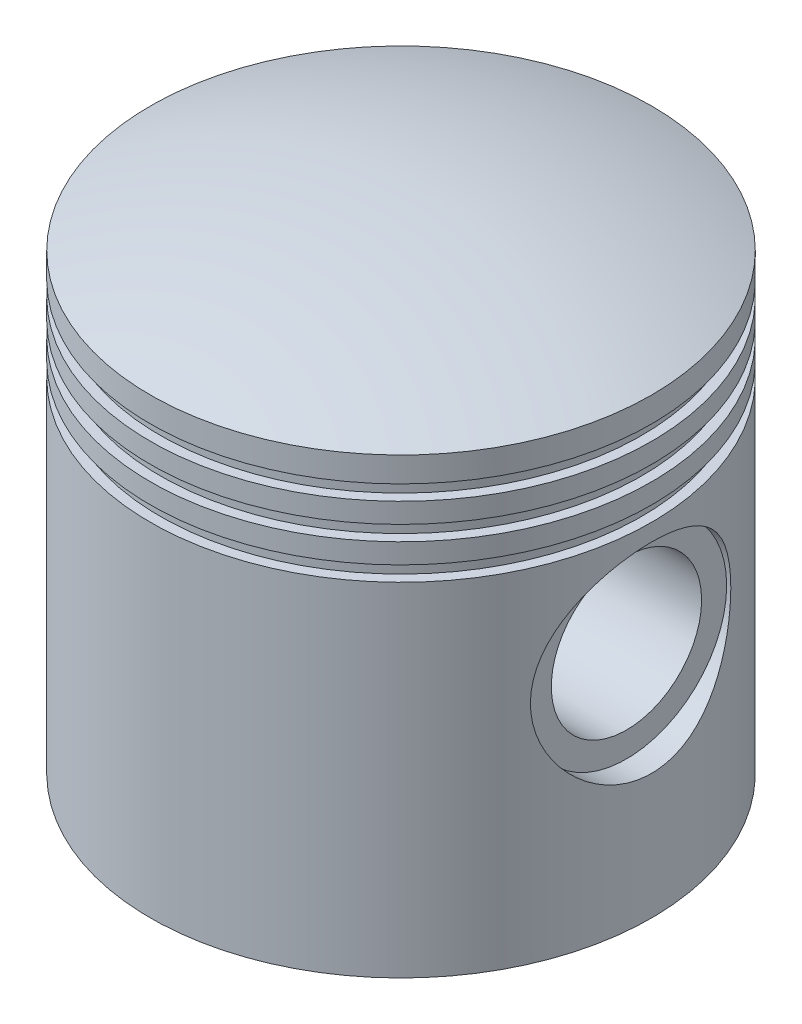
ISO-10303-21;
HEADER;
FILE_DESCRIPTION(('STEP AP214'),'2;1');
FILE_NAME('part.step','',(''),(''),'','','');
FILE_SCHEMA(('AUTOMOTIVE_DESIGN { 1 0 10303 214 1 1 1 1 }'));
ENDSEC;
DATA;
#1=APPLICATION_CONTEXT('core data for automotive mechanical design processes');
#2=APPLICATION_PROTOCOL_DEFINITION('international standard','automotive_design',2000,#1);
#3=PRODUCT_CONTEXT('',#1,'mechanical');
#4=PRODUCT('Part','Part','',(#3));
#5=PRODUCT_RELATED_PRODUCT_CATEGORY('part','',(#4));
#6=PRODUCT_DEFINITION_FORMATION('','',#4);
#7=PRODUCT_DEFINITION_CONTEXT('part definition',#1,'design');
#8=PRODUCT_DEFINITION('design','',#6,#7);
#9=PRODUCT_DEFINITION_SHAPE('','',#8);
#10=(LENGTH_UNIT() NAMED_UNIT(*) SI_UNIT(.MILLI.,.METRE.));
#11=(NAMED_UNIT(*) PLANE_ANGLE_UNIT() SI_UNIT($,.RADIAN.));
#12=(NAMED_UNIT(*) SI_UNIT($,.STERADIAN.) SOLID_ANGLE_UNIT());
#13=UNCERTAINTY_MEASURE_WITH_UNIT(LENGTH_MEASURE(1.E-05),#10,'distance_accuracy_value','');
#14=(GEOMETRIC_REPRESENTATION_CONTEXT(3) GLOBAL_UNCERTAINTY_ASSIGNED_CONTEXT((#13)) GLOBAL_UNIT_ASSIGNED_CONTEXT((#10,
#11,#12)) REPRESENTATION_CONTEXT('',''));
#15=CARTESIAN_POINT('',(0.,0.,0.));
#16=DIRECTION('',(0.,0.,1.));
#17=DIRECTION('',(1.,0.,0.));
#18=AXIS2_PLACEMENT_3D('',#15,#16,#17);
#19=CARTESIAN_POINT('',(0.,0.,0.));
#20=DIRECTION('',(0.,-1.,0.));
#21=DIRECTION('',(0.,0.,-1.));
#22=AXIS2_PLACEMENT_3D('',#19,#20,#21);
#23=CYLINDRICAL_SURFACE('',#22,50.);
#24=CARTESIAN_POINT('',(0.,0.,0.));
#25=DIRECTION('',(0.,-1.,0.));
#26=DIRECTION('',(0.,0.,-1.));
#27=AXIS2_PLACEMENT_3D('',#24,#25,#26);
#28=CIRCLE('',#27,50.);
#29=CARTESIAN_POINT('',(0.,0.,-50.));
#30=VERTEX_POINT('',#29);
#31=EDGE_CURVE('E176',#30,#30,#28,.T.);
#32=ORIENTED_EDGE('',*,*,#31,.F.);
#33=EDGE_LOOP('',(#32));
#34=FACE_BOUND('',#33,.T.);
#35=CARTESIAN_POINT('',(0.,68.3993620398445,0.));
#36=DIRECTION('',(0.,-1.,0.));
#37=DIRECTION('',(0.,0.,-1.));
#38=AXIS2_PLACEMENT_3D('',#35,#36,#37);
#39=CIRCLE('',#38,50.);
#40=CARTESIAN_POINT('',(0.,68.3993620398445,-50.));
#41=VERTEX_POINT('',#40);
#42=EDGE_CURVE('E172',#41,#41,#39,.T.);
#43=ORIENTED_EDGE('',*,*,#42,.T.);
#44=EDGE_LOOP('',(#43));
#45=FACE_BOUND('',#44,.T.);
#46=CARTESIAN_POINT('',(45.8257569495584,45.,-20.));
#47=CARTESIAN_POINT('',(45.8257610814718,45.5358865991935,-19.9999958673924));
#48=CARTESIAN_POINT('',(45.8351884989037,46.071936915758,-19.9784325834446));
#49=CARTESIAN_POINT('',(45.8725951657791,47.1401628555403,-19.8923890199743));
#50=CARTESIAN_POINT('',(45.9005857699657,47.6723359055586,-19.8278824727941));
#51=CARTESIAN_POINT('',(45.9742616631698,48.7298193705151,-19.6564487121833));
#52=CARTESIAN_POINT('',(46.0199871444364,49.255111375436,-19.5494251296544));
#53=CARTESIAN_POINT('',(46.1276168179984,50.2937585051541,-19.2940953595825));
#54=CARTESIAN_POINT('',(46.1895186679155,50.807115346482,-19.1457951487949));
#55=CARTESIAN_POINT('',(46.3272933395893,51.8166918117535,-18.8099619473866));
#56=CARTESIAN_POINT('',(46.4031126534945,52.3129687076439,-18.6225788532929));
#57=CARTESIAN_POINT('',(46.5666282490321,53.2874390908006,-18.2098426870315));
#58=CARTESIAN_POINT('',(46.6543249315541,53.7656319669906,-17.9844883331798));
#59=CARTESIAN_POINT('',(46.8390874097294,54.7010448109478,-17.4976458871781));
#60=CARTESIAN_POINT('',(46.9361487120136,55.1582746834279,-17.2361750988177));
#61=CARTESIAN_POINT('',(47.1371316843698,56.0497918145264,-16.6786876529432));
#62=CARTESIAN_POINT('',(47.2410558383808,56.4840706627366,-16.3826584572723));
#63=CARTESIAN_POINT('',(47.4585884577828,57.3491640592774,-15.74175060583));
#64=CARTESIAN_POINT('',(47.5724198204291,57.7786385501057,-15.3951376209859));
#65=CARTESIAN_POINT('',(47.8016661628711,58.6072720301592,-14.6678582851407));
#66=CARTESIAN_POINT('',(47.9170811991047,59.0064299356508,-14.2871907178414));
#67=CARTESIAN_POINT('',(48.1465353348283,59.7723542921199,-13.4937664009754));
#68=CARTESIAN_POINT('',(48.2605736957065,60.139103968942,-13.0809932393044));
#69=CARTESIAN_POINT('',(48.4842338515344,60.8376258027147,-12.2259665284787));
#70=CARTESIAN_POINT('',(48.5938571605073,61.169410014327,-11.7837232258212));
#71=CARTESIAN_POINT('',(48.8101239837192,61.8083958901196,-10.8539621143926));
#72=CARTESIAN_POINT('',(48.9164762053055,62.1140977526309,-10.365343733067));
#73=CARTESIAN_POINT('',(49.1184128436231,62.6830209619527,-9.36180834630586));
#74=CARTESIAN_POINT('',(49.2139968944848,62.9462408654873,-8.84689044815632));
#75=CARTESIAN_POINT('',(49.3916204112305,63.4277575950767,-7.79439063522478));
#76=CARTESIAN_POINT('',(49.4736641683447,63.6460686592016,-7.25681596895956));
#77=CARTESIAN_POINT('',(49.6218189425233,64.0356878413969,-6.1627677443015));
#78=CARTESIAN_POINT('',(49.6879309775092,64.2069989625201,-5.60629539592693));
#79=CARTESIAN_POINT('',(49.7994561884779,64.4936502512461,-4.50610014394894));
#80=CARTESIAN_POINT('',(49.8457163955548,64.6112983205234,-3.96306396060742));
#81=CARTESIAN_POINT('',(49.920700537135,64.8011102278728,-2.86789881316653));
#82=CARTESIAN_POINT('',(49.9494249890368,64.8732754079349,-2.3157701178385));
#83=CARTESIAN_POINT('',(49.9885081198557,64.9713035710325,-1.20694559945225));
#84=CARTESIAN_POINT('',(49.9988726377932,64.997181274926,-0.650251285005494));
#85=CARTESIAN_POINT('',(50.0009527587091,65.0023822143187,0.463380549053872));
#86=CARTESIAN_POINT('',(49.9926690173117,64.9817070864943,1.02031805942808));
#87=CARTESIAN_POINT('',(49.9586825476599,64.8965161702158,2.09870166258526));
#88=CARTESIAN_POINT('',(49.9339859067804,64.8345319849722,2.62038187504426));
#89=CARTESIAN_POINT('',(49.8688378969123,64.6699442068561,3.65627016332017));
#90=CARTESIAN_POINT('',(49.8283872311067,64.5673424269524,4.17047857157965));
#91=CARTESIAN_POINT('',(49.7327468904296,64.3224946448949,5.18797068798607));
#92=CARTESIAN_POINT('',(49.6775566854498,64.1802472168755,5.69125400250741));
#93=CARTESIAN_POINT('',(49.5537962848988,63.8573843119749,6.683663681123));
#94=CARTESIAN_POINT('',(49.4852257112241,63.676767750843,7.17278964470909));
#95=CARTESIAN_POINT('',(49.3352329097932,63.275675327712,8.14115863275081));
#96=CARTESIAN_POINT('',(49.2536330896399,63.0546414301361,8.62014279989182));
#97=CARTESIAN_POINT('',(49.0803147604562,62.5763184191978,9.5577201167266));
#98=CARTESIAN_POINT('',(48.9885962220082,62.3190292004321,10.0163132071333));
#99=CARTESIAN_POINT('',(48.7971930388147,61.7699804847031,10.9106889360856));
#100=CARTESIAN_POINT('',(48.6975074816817,61.4782170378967,11.3464689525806));
#101=CARTESIAN_POINT('',(48.4924600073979,60.8620022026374,12.1930769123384));
#102=CARTESIAN_POINT('',(48.3870960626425,60.5375391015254,12.6038958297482));
#103=CARTESIAN_POINT('',(48.1661398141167,59.8356036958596,13.4244227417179));
#104=CARTESIAN_POINT('',(48.0503296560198,59.4560511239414,13.8322944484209));
#105=CARTESIAN_POINT('',(47.8181047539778,58.6643456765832,14.6149072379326));
#106=CARTESIAN_POINT('',(47.7016899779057,58.2521910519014,14.9896465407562));
#107=CARTESIAN_POINT('',(47.47132597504,57.3974281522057,15.7039527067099));
#108=CARTESIAN_POINT('',(47.3573780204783,56.9548046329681,16.0435017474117));
#109=CARTESIAN_POINT('',(47.1352150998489,56.041937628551,16.6849239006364));
#110=CARTESIAN_POINT('',(47.0269980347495,55.5717043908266,16.9868108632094));
#111=CARTESIAN_POINT('',(46.8164279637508,54.5923423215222,17.5589772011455));
#112=CARTESIAN_POINT('',(46.7143304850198,54.0824864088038,17.8281085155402));
#113=CARTESIAN_POINT('',(46.5227891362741,53.0394432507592,18.322126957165));
#114=CARTESIAN_POINT('',(46.4333456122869,52.5062553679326,18.5470128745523));
#115=CARTESIAN_POINT('',(46.2702422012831,51.4205243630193,18.9502511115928));
#116=CARTESIAN_POINT('',(46.1965739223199,50.8679917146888,19.1286281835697));
#117=CARTESIAN_POINT('',(46.0676591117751,49.7475015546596,19.4370470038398));
#118=CARTESIAN_POINT('',(46.0124110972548,49.179545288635,19.5670926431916));
#119=CARTESIAN_POINT('',(45.9252013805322,48.0679232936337,19.7708720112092));
#120=CARTESIAN_POINT('',(45.8920231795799,47.5248935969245,19.8475608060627));
#121=CARTESIAN_POINT('',(45.8449334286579,46.4335414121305,19.9560921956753));
#122=CARTESIAN_POINT('',(45.8310210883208,45.8852191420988,19.9879366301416));
#123=CARTESIAN_POINT('',(45.8229639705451,44.7878166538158,20.0064007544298));
#124=CARTESIAN_POINT('',(45.8288139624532,44.2387366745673,19.9930324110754));
#125=CARTESIAN_POINT('',(45.8600596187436,43.1441010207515,19.9212565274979));
#126=CARTESIAN_POINT('',(45.8854547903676,42.5985452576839,19.8628501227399));
#127=CARTESIAN_POINT('',(45.9528988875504,41.5461885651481,19.7062897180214));
#128=CARTESIAN_POINT('',(45.99391474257,41.0389526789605,19.6105941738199));
#129=CARTESIAN_POINT('',(46.0912506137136,40.0348119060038,19.3807166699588));
#130=CARTESIAN_POINT('',(46.1475699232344,39.5379065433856,19.2465364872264));
#131=CARTESIAN_POINT('',(46.2738630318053,38.5574191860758,18.9408793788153));
#132=CARTESIAN_POINT('',(46.3438390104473,38.0738393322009,18.7693964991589));
#133=CARTESIAN_POINT('',(46.4954754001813,37.1228400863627,18.3905510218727));
#134=CARTESIAN_POINT('',(46.5771363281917,36.6554214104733,18.1831868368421));
#135=CARTESIAN_POINT('',(46.7534706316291,35.7206593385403,17.7250002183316));
#136=CARTESIAN_POINT('',(46.8485372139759,35.2540865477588,17.4727572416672));
#137=CARTESIAN_POINT('',(47.0463681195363,34.3436281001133,16.9328637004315));
#138=CARTESIAN_POINT('',(47.1491325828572,33.8997428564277,16.6452124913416));
#139=CARTESIAN_POINT('',(47.3597267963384,33.0367686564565,16.0362118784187));
#140=CARTESIAN_POINT('',(47.4675582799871,32.6176882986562,15.7148508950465));
#141=CARTESIAN_POINT('',(47.6855704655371,31.8065827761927,15.0403452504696));
#142=CARTESIAN_POINT('',(47.7957512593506,31.4145586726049,14.6871993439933));
#143=CARTESIAN_POINT('',(48.0239443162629,30.6316441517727,13.9237555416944));
#144=CARTESIAN_POINT('',(48.1419332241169,30.242981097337,13.5111624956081));
#145=CARTESIAN_POINT('',(48.3743367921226,29.5015999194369,12.6538833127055));
#146=CARTESIAN_POINT('',(48.4887512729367,29.1488835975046,12.2091955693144));
#147=CARTESIAN_POINT('',(48.7109080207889,28.4817826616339,11.2902987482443));
#148=CARTESIAN_POINT('',(48.8186497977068,28.1674008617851,10.8160875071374));
#149=CARTESIAN_POINT('',(49.0245043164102,27.5793831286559,9.84104668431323));
#150=CARTESIAN_POINT('',(49.1226172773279,27.3057462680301,9.34021770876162));
#151=CARTESIAN_POINT('',(49.3064714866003,26.8015592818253,8.31522012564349));
#152=CARTESIAN_POINT('',(49.3922147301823,26.5710022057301,7.79105530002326));
#153=CARTESIAN_POINT('',(49.5489020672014,26.1550847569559,6.72291751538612));
#154=CARTESIAN_POINT('',(49.6198460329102,25.9697247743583,6.17894438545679));
#155=CARTESIAN_POINT('',(49.7448238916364,25.646194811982,5.07549344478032));
#156=CARTESIAN_POINT('',(49.7988653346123,25.508003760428,4.51602267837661));
#157=CARTESIAN_POINT('',(49.8884502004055,25.2802520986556,3.38582023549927));
#158=CARTESIAN_POINT('',(49.9239948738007,25.1906882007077,2.81508932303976));
#159=CARTESIAN_POINT('',(49.9738194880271,25.0654652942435,1.70465408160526));
#160=CARTESIAN_POINT('',(49.9893362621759,25.0266686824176,1.16535687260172));
#161=CARTESIAN_POINT('',(50.0028441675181,24.9928842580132,0.0851841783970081));
#162=CARTESIAN_POINT('',(50.0008361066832,24.9978944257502,-0.455691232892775));
#163=CARTESIAN_POINT('',(49.9793510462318,25.051663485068,-1.53483052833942));
#164=CARTESIAN_POINT('',(49.9598764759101,25.1004162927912,-2.07309476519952));
#165=CARTESIAN_POINT('',(49.9039902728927,25.2411434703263,-3.14304537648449));
#166=CARTESIAN_POINT('',(49.8675787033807,25.3331176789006,-3.67473177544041));
#167=CARTESIAN_POINT('',(49.7801638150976,25.5558531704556,-4.71142775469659));
#168=CARTESIAN_POINT('',(49.7296444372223,25.6853326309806,-5.21675461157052));
#169=CARTESIAN_POINT('',(49.614861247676,25.9828162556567,-6.2143079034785));
#170=CARTESIAN_POINT('',(49.5505978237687,26.1508193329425,-6.70653470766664));
#171=CARTESIAN_POINT('',(49.4098622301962,26.5239525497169,-7.67495846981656));
#172=CARTESIAN_POINT('',(49.3333885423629,26.7290873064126,-8.15115342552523));
#173=CARTESIAN_POINT('',(49.1700300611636,27.1748813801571,-9.08475454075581));
#174=CARTESIAN_POINT('',(49.0831448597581,27.4155420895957,-9.54215996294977));
#175=CARTESIAN_POINT('',(48.8969270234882,27.9420763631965,-10.4554878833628));
#176=CARTESIAN_POINT('',(48.7972140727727,28.2294775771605,-10.9104522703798));
#177=CARTESIAN_POINT('',(48.5910504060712,28.8391686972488,-11.7947440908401));
#178=CARTESIAN_POINT('',(48.4845995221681,29.161459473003,-12.2240708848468));
#179=CARTESIAN_POINT('',(48.2675286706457,29.8389548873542,-13.0548865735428));
#180=CARTESIAN_POINT('',(48.1569081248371,30.1941641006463,-13.456371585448));
#181=CARTESIAN_POINT('',(47.9341495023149,30.935585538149,-14.2295209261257));
#182=CARTESIAN_POINT('',(47.8220107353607,31.3218122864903,-14.601171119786));
#183=CARTESIAN_POINT('',(47.5921107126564,32.1479193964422,-15.3345260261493));
#184=CARTESIAN_POINT('',(47.4744319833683,32.5896416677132,-15.6941850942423));
#185=CARTESIAN_POINT('',(47.2439551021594,33.5027684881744,-16.3749144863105));
#186=CARTESIAN_POINT('',(47.131154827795,33.9741599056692,-16.6960017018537));
#187=CARTESIAN_POINT('',(46.9136903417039,34.9442627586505,-17.2976314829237));
#188=CARTESIAN_POINT('',(46.8090299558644,35.4429868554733,-17.5781550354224));
#189=CARTESIAN_POINT('',(46.6112099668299,36.4644393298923,-18.0961883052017));
#190=CARTESIAN_POINT('',(46.5180487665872,36.9871643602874,-18.333703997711));
#191=CARTESIAN_POINT('',(46.3540414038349,38.0052588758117,-18.7442584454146));
#192=CARTESIAN_POINT('',(46.281942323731,38.4988662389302,-18.9211729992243));
#193=CARTESIAN_POINT('',(46.1519329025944,39.5002467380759,-19.2361160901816));
#194=CARTESIAN_POINT('',(46.0940237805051,40.0080210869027,-19.3741412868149));
#195=CARTESIAN_POINT('',(45.9943136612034,41.0330786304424,-19.6096772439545));
#196=CARTESIAN_POINT('',(45.9524727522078,41.550334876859,-19.7072884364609));
#197=CARTESIAN_POINT('',(45.8860508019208,42.5918149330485,-19.8614566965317));
#198=CARTESIAN_POINT('',(45.8614597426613,43.1160345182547,-19.9180375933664));
#199=CARTESIAN_POINT('',(45.8391844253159,43.8677507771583,-19.9692106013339));
#200=CARTESIAN_POINT('',(45.8341531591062,44.0939985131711,-19.9807526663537));
#201=CARTESIAN_POINT('',(45.827438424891,44.5468210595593,-19.9961485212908));
#202=CARTESIAN_POINT('',(45.8257552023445,44.7733958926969,-20.0000017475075));
#203=CARTESIAN_POINT('',(45.8257569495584,45.,-20.));
#204=B_SPLINE_CURVE_WITH_KNOTS('',3,(#46,#47,#48,#49,#50,#51,#52,#53,#54,#55,#56,#57,#58,#59,
#60,#61,#62,#63,#64,#65,#66,#67,#68,#69,#70,#71,#72,#73,#74,#75,#76,#77,#78,#79,#80,#81,#82,#83,
#84,#85,#86,#87,#88,#89,#90,#91,#92,#93,#94,#95,#96,#97,#98,#99,#100,#101,#102,#103,#104,#105,
#106,#107,#108,#109,#110,#111,#112,#113,#114,#115,#116,#117,#118,#119,#120,#121,#122,#123,#124,
#125,#126,#127,#128,#129,#130,#131,#132,#133,#134,#135,#136,#137,#138,#139,#140,#141,#142,#143,
#144,#145,#146,#147,#148,#149,#150,#151,#152,#153,#154,#155,#156,#157,#158,#159,#160,#161,#162,
#163,#164,#165,#166,#167,#168,#169,#170,#171,#172,#173,#174,#175,#176,#177,#178,#179,#180,#181,
#182,#183,#184,#185,#186,#187,#188,#189,#190,#191,#192,#193,#194,#195,#196,#197,#198,#199,#200,
#201,#202,#203),.UNSPECIFIED.,.T.,.F.,(4,2,2,2,2,2,2,2,2,2,2,2,2,2,2,2,2,2,2,2,2,2,2,2,2,2,2,2,
2,2,2,2,2,2,2,2,2,2,2,2,2,2,2,2,2,2,2,2,2,2,2,2,2,2,2,2,2,2,2,2,2,2,2,2,2,2,2,2,2,2,2,2,2,2,2,2,
2,2,4),(0.,1.60743041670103,3.21584497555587,4.82792615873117,6.43977403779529,8.04554999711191,
9.65138016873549,11.2564436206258,12.8620912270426,14.5507565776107,16.2394822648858,
17.9290769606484,19.6180872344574,21.3741828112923,23.1303380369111,24.8859356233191,
26.6414210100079,28.3119313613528,29.9823924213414,31.6523221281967,33.3221931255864,
34.8981285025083,36.4739935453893,38.0499152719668,39.6258815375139,41.2255232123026,
42.8251695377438,44.4249993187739,46.0254041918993,47.7306649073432,49.4360171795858,
51.1422289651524,52.8478114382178,54.6020741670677,56.3563848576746,58.109759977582,
59.8629939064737,61.5091097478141,63.1551580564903,64.8007707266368,66.44634191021,
67.9980063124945,69.5495990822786,71.1014396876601,72.6533489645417,74.2681462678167,
75.8829729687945,77.4983562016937,79.1138027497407,80.8487034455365,82.5836910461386,
84.3188059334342,86.0538813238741,87.7886765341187,89.5234867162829,91.2575208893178,
92.9914378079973,94.6121495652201,96.2327866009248,97.8531982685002,99.4736038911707,
101.044103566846,102.614558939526,104.185209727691,105.755922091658,107.396020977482,
109.036160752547,110.676528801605,112.317669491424,114.060572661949,115.80270976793,
117.545660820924,119.288369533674,120.874494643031,122.460755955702,124.043051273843,
125.624426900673,126.304092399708,126.983807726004),.UNSPECIFIED.);
#205=CARTESIAN_POINT('',(45.8257569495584,45.,-20.));
#206=VERTEX_POINT('',#205);
#207=EDGE_CURVE('E62',#206,#206,#204,.T.);
#208=ORIENTED_EDGE('',*,*,#207,.F.);
#209=EDGE_LOOP('',(#208));
#210=FACE_BOUND('',#209,.T.);
#211=CARTESIAN_POINT('',(-45.8257569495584,45.,20.));
#212=CARTESIAN_POINT('',(-45.8257610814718,44.4641134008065,19.9999958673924));
#213=CARTESIAN_POINT('',(-45.8351884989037,43.928063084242,19.9784325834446));
#214=CARTESIAN_POINT('',(-45.8725951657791,42.8598371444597,19.8923890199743));
#215=CARTESIAN_POINT('',(-45.9005857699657,42.3276640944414,19.8278824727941));
#216=CARTESIAN_POINT('',(-45.9742616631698,41.2701806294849,19.6564487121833));
#217=CARTESIAN_POINT('',(-46.0199871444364,40.7448886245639,19.5494251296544));
#218=CARTESIAN_POINT('',(-46.1276168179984,39.7062414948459,19.2940953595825));
#219=CARTESIAN_POINT('',(-46.1895186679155,39.192884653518,19.1457951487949));
#220=CARTESIAN_POINT('',(-46.3272933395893,38.1833081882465,18.8099619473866));
#221=CARTESIAN_POINT('',(-46.4031126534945,37.6870312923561,18.6225788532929));
#222=CARTESIAN_POINT('',(-46.5666282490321,36.7125609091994,18.2098426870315));
#223=CARTESIAN_POINT('',(-46.6543249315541,36.2343680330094,17.9844883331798));
#224=CARTESIAN_POINT('',(-46.8390874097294,35.2989551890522,17.4976458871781));
#225=CARTESIAN_POINT('',(-46.9361487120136,34.8417253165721,17.2361750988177));
#226=CARTESIAN_POINT('',(-47.1371316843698,33.9502081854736,16.6786876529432));
#227=CARTESIAN_POINT('',(-47.2410558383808,33.5159293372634,16.3826584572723));
#228=CARTESIAN_POINT('',(-47.4585884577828,32.6508359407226,15.74175060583));
#229=CARTESIAN_POINT('',(-47.5724198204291,32.2213614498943,15.3951376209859));
#230=CARTESIAN_POINT('',(-47.8016661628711,31.3927279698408,14.6678582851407));
#231=CARTESIAN_POINT('',(-47.9170811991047,30.9935700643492,14.2871907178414));
#232=CARTESIAN_POINT('',(-48.1465353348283,30.2276457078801,13.4937664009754));
#233=CARTESIAN_POINT('',(-48.2605736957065,29.860896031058,13.0809932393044));
#234=CARTESIAN_POINT('',(-48.4842338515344,29.1623741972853,12.2259665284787));
#235=CARTESIAN_POINT('',(-48.5938571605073,28.830589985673,11.7837232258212));
#236=CARTESIAN_POINT('',(-48.8101239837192,28.1916041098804,10.8539621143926));
#237=CARTESIAN_POINT('',(-48.9164762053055,27.8859022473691,10.365343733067));
#238=CARTESIAN_POINT('',(-49.1184128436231,27.3169790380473,9.36180834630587));
#239=CARTESIAN_POINT('',(-49.2139968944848,27.0537591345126,8.84689044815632));
#240=CARTESIAN_POINT('',(-49.3916204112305,26.5722424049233,7.79439063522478));
#241=CARTESIAN_POINT('',(-49.4736641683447,26.3539313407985,7.25681596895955));
#242=CARTESIAN_POINT('',(-49.6218189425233,25.9643121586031,6.16276774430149));
#243=CARTESIAN_POINT('',(-49.6879309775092,25.7930010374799,5.60629539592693));
#244=CARTESIAN_POINT('',(-49.7994561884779,25.5063497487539,4.50610014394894));
#245=CARTESIAN_POINT('',(-49.8457163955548,25.3887016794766,3.96306396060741));
#246=CARTESIAN_POINT('',(-49.920700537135,25.1988897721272,2.86789881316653));
#247=CARTESIAN_POINT('',(-49.9494249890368,25.1267245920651,2.3157701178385));
#248=CARTESIAN_POINT('',(-49.9885081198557,25.0286964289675,1.20694559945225));
#249=CARTESIAN_POINT('',(-49.9988726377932,25.002818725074,0.650251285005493));
#250=CARTESIAN_POINT('',(-50.0009527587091,24.9976177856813,-0.463380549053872));
#251=CARTESIAN_POINT('',(-49.9926690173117,25.0182929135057,-1.02031805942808));
#252=CARTESIAN_POINT('',(-49.9586825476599,25.1034838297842,-2.09870166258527));
#253=CARTESIAN_POINT('',(-49.9339859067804,25.1654680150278,-2.62038187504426));
#254=CARTESIAN_POINT('',(-49.8688378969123,25.3300557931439,-3.65627016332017));
#255=CARTESIAN_POINT('',(-49.8283872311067,25.4326575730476,-4.17047857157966));
#256=CARTESIAN_POINT('',(-49.7327468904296,25.6775053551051,-5.18797068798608));
#257=CARTESIAN_POINT('',(-49.6775566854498,25.8197527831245,-5.69125400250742));
#258=CARTESIAN_POINT('',(-49.5537962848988,26.1426156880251,-6.683663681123));
#259=CARTESIAN_POINT('',(-49.4852257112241,26.323232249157,-7.17278964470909));
#260=CARTESIAN_POINT('',(-49.3352329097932,26.724324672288,-8.14115863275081));
#261=CARTESIAN_POINT('',(-49.2536330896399,26.9453585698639,-8.62014279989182));
#262=CARTESIAN_POINT('',(-49.0803147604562,27.4236815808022,-9.55772011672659));
#263=CARTESIAN_POINT('',(-48.9885962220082,27.6809707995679,-10.0163132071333));
#264=CARTESIAN_POINT('',(-48.7971930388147,28.2300195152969,-10.9106889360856));
#265=CARTESIAN_POINT('',(-48.6975074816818,28.5217829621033,-11.3464689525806));
#266=CARTESIAN_POINT('',(-48.4924600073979,29.1379977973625,-12.1930769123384));
#267=CARTESIAN_POINT('',(-48.3870960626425,29.4624608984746,-12.6038958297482));
#268=CARTESIAN_POINT('',(-48.1661398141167,30.1643963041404,-13.4244227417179));
#269=CARTESIAN_POINT('',(-48.0503296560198,30.5439488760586,-13.8322944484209));
#270=CARTESIAN_POINT('',(-47.8181047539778,31.3356543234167,-14.6149072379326));
#271=CARTESIAN_POINT('',(-47.7016899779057,31.7478089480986,-14.9896465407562));
#272=CARTESIAN_POINT('',(-47.47132597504,32.6025718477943,-15.7039527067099));
#273=CARTESIAN_POINT('',(-47.3573780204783,33.0451953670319,-16.0435017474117));
#274=CARTESIAN_POINT('',(-47.1352150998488,33.958062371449,-16.6849239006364));
#275=CARTESIAN_POINT('',(-47.0269980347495,34.4282956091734,-16.9868108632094));
#276=CARTESIAN_POINT('',(-46.8164279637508,35.4076576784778,-17.5589772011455));
#277=CARTESIAN_POINT('',(-46.7143304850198,35.9175135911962,-17.8281085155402));
#278=CARTESIAN_POINT('',(-46.5227891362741,36.9605567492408,-18.3221269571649));
#279=CARTESIAN_POINT('',(-46.4333456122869,37.4937446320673,-18.5470128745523));
#280=CARTESIAN_POINT('',(-46.2702422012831,38.5794756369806,-18.9502511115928));
#281=CARTESIAN_POINT('',(-46.1965739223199,39.1320082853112,-19.1286281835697));
#282=CARTESIAN_POINT('',(-46.0676591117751,40.2524984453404,-19.4370470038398));
#283=CARTESIAN_POINT('',(-46.0124110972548,40.820454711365,-19.5670926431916));
#284=CARTESIAN_POINT('',(-45.9252013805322,41.9320767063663,-19.7708720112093));
#285=CARTESIAN_POINT('',(-45.8920231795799,42.4751064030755,-19.8475608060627));
#286=CARTESIAN_POINT('',(-45.8449334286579,43.5664585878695,-19.9560921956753));
#287=CARTESIAN_POINT('',(-45.8310210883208,44.1147808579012,-19.9879366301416));
#288=CARTESIAN_POINT('',(-45.8229639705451,45.2121833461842,-20.0064007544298));
#289=CARTESIAN_POINT('',(-45.8288139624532,45.7612633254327,-19.9930324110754));
#290=CARTESIAN_POINT('',(-45.8600596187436,46.8558989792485,-19.9212565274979));
#291=CARTESIAN_POINT('',(-45.8854547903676,47.4014547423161,-19.8628501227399));
#292=CARTESIAN_POINT('',(-45.9528988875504,48.4538114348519,-19.7062897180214));
#293=CARTESIAN_POINT('',(-45.99391474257,48.9610473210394,-19.6105941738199));
#294=CARTESIAN_POINT('',(-46.0912506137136,49.9651880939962,-19.3807166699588));
#295=CARTESIAN_POINT('',(-46.1475699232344,50.4620934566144,-19.2465364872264));
#296=CARTESIAN_POINT('',(-46.2738630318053,51.4425808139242,-18.9408793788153));
#297=CARTESIAN_POINT('',(-46.3438390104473,51.9261606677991,-18.7693964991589));
#298=CARTESIAN_POINT('',(-46.4954754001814,52.8771599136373,-18.3905510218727));
#299=CARTESIAN_POINT('',(-46.5771363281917,53.3445785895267,-18.1831868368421));
#300=CARTESIAN_POINT('',(-46.7534706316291,54.2793406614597,-17.7250002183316));
#301=CARTESIAN_POINT('',(-46.8485372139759,54.7459134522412,-17.4727572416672));
#302=CARTESIAN_POINT('',(-47.0463681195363,55.6563718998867,-16.9328637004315));
#303=CARTESIAN_POINT('',(-47.1491325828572,56.1002571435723,-16.6452124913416));
#304=CARTESIAN_POINT('',(-47.3597267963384,56.9632313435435,-16.0362118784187));
#305=CARTESIAN_POINT('',(-47.4675582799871,57.3823117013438,-15.7148508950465));
#306=CARTESIAN_POINT('',(-47.6855704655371,58.1934172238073,-15.0403452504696));
#307=CARTESIAN_POINT('',(-47.7957512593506,58.5854413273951,-14.6871993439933));
#308=CARTESIAN_POINT('',(-48.0239443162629,59.3683558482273,-13.9237555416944));
#309=CARTESIAN_POINT('',(-48.141933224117,59.757018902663,-13.5111624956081));
#310=CARTESIAN_POINT('',(-48.3743367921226,60.4984000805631,-12.6538833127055));
#311=CARTESIAN_POINT('',(-48.4887512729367,60.8511164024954,-12.2091955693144));
#312=CARTESIAN_POINT('',(-48.7109080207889,61.5182173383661,-11.2902987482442));
#313=CARTESIAN_POINT('',(-48.8186497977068,61.8325991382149,-10.8160875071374));
#314=CARTESIAN_POINT('',(-49.0245043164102,62.4206168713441,-9.84104668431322));
#315=CARTESIAN_POINT('',(-49.1226172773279,62.6942537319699,-9.34021770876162));
#316=CARTESIAN_POINT('',(-49.3064714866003,63.1984407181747,-8.31522012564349));
#317=CARTESIAN_POINT('',(-49.3922147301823,63.4289977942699,-7.79105530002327));
#318=CARTESIAN_POINT('',(-49.5489020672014,63.8449152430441,-6.72291751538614));
#319=CARTESIAN_POINT('',(-49.6198460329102,64.0302752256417,-6.17894438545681));
#320=CARTESIAN_POINT('',(-49.7448238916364,64.353805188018,-5.07549344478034));
#321=CARTESIAN_POINT('',(-49.7988653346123,64.491996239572,-4.51602267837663));
#322=CARTESIAN_POINT('',(-49.8884502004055,64.7197479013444,-3.38582023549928));
#323=CARTESIAN_POINT('',(-49.9239948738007,64.8093117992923,-2.81508932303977));
#324=CARTESIAN_POINT('',(-49.9738194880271,64.9345347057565,-1.70465408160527));
#325=CARTESIAN_POINT('',(-49.9893362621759,64.9733313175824,-1.16535687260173));
#326=CARTESIAN_POINT('',(-50.0028441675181,65.0071157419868,-0.0851841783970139));
#327=CARTESIAN_POINT('',(-50.0008361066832,65.0021055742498,0.45569123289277));
#328=CARTESIAN_POINT('',(-49.9793510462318,64.948336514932,1.53483052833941));
#329=CARTESIAN_POINT('',(-49.9598764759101,64.8995837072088,2.07309476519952));
#330=CARTESIAN_POINT('',(-49.9039902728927,64.7588565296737,3.14304537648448));
#331=CARTESIAN_POINT('',(-49.8675787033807,64.6668823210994,3.6747317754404));
#332=CARTESIAN_POINT('',(-49.7801638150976,64.4441468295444,4.71142775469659));
#333=CARTESIAN_POINT('',(-49.7296444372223,64.3146673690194,5.21675461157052));
#334=CARTESIAN_POINT('',(-49.614861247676,64.0171837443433,6.2143079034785));
#335=CARTESIAN_POINT('',(-49.5505978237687,63.8491806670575,6.70653470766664));
#336=CARTESIAN_POINT('',(-49.4098622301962,63.4760474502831,7.67495846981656));
#337=CARTESIAN_POINT('',(-49.3333885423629,63.2709126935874,8.15115342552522));
#338=CARTESIAN_POINT('',(-49.1700300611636,62.8251186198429,9.0847545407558));
#339=CARTESIAN_POINT('',(-49.0831448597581,62.5844579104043,9.54215996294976));
#340=CARTESIAN_POINT('',(-48.8969270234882,62.0579236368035,10.4554878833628));
#341=CARTESIAN_POINT('',(-48.7972140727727,61.7705224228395,10.9104522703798));
#342=CARTESIAN_POINT('',(-48.5910504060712,61.1608313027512,11.7947440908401));
#343=CARTESIAN_POINT('',(-48.4845995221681,60.838540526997,12.2240708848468));
#344=CARTESIAN_POINT('',(-48.2675286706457,60.1610451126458,13.0548865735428));
#345=CARTESIAN_POINT('',(-48.1569081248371,59.8058358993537,13.456371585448));
#346=CARTESIAN_POINT('',(-47.9341495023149,59.064414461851,14.2295209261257));
#347=CARTESIAN_POINT('',(-47.8220107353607,58.6781877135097,14.601171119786));
#348=CARTESIAN_POINT('',(-47.5921107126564,57.8520806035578,15.3345260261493));
#349=CARTESIAN_POINT('',(-47.4744319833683,57.4103583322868,15.6941850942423));
#350=CARTESIAN_POINT('',(-47.2439551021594,56.4972315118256,16.3749144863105));
#351=CARTESIAN_POINT('',(-47.131154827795,56.0258400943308,16.6960017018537));
#352=CARTESIAN_POINT('',(-46.9136903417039,55.0557372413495,17.2976314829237));
#353=CARTESIAN_POINT('',(-46.8090299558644,54.5570131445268,17.5781550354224));
#354=CARTESIAN_POINT('',(-46.6112099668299,53.5355606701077,18.0961883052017));
#355=CARTESIAN_POINT('',(-46.5180487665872,53.0128356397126,18.333703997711));
#356=CARTESIAN_POINT('',(-46.3540414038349,51.9947411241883,18.7442584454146));
#357=CARTESIAN_POINT('',(-46.2819423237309,51.5011337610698,18.9211729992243));
#358=CARTESIAN_POINT('',(-46.1519329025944,50.4997532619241,19.2361160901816));
#359=CARTESIAN_POINT('',(-46.0940237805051,49.9919789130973,19.3741412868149));
#360=CARTESIAN_POINT('',(-45.9943136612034,48.9669213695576,19.6096772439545));
#361=CARTESIAN_POINT('',(-45.9524727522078,48.449665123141,19.7072884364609));
#362=CARTESIAN_POINT('',(-45.8860508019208,47.4081850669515,19.8614566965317));
#363=CARTESIAN_POINT('',(-45.8614597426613,46.8839654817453,19.9180375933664));
#364=CARTESIAN_POINT('',(-45.8391844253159,46.1322492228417,19.9692106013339));
#365=CARTESIAN_POINT('',(-45.8341531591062,45.9060014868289,19.9807526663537));
#366=CARTESIAN_POINT('',(-45.827438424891,45.4531789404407,19.9961485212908));
#367=CARTESIAN_POINT('',(-45.8257552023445,45.2266041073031,20.0000017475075));
#368=CARTESIAN_POINT('',(-45.8257569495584,45.,20.));
#369=B_SPLINE_CURVE_WITH_KNOTS('',3,(#211,#212,#213,#214,#215,#216,#217,#218,#219,#220,#221,
#222,#223,#224,#225,#226,#227,#228,#229,#230,#231,#232,#233,#234,#235,#236,#237,#238,#239,#240,
#241,#242,#243,#244,#245,#246,#247,#248,#249,#250,#251,#252,#253,#254,#255,#256,#257,#258,#259,
#260,#261,#262,#263,#264,#265,#266,#267,#268,#269,#270,#271,#272,#273,#274,#275,#276,#277,#278,
#279,#280,#281,#282,#283,#284,#285,#286,#287,#288,#289,#290,#291,#292,#293,#294,#295,#296,#297,
#298,#299,#300,#301,#302,#303,#304,#305,#306,#307,#308,#309,#310,#311,#312,#313,#314,#315,#316,
#317,#318,#319,#320,#321,#322,#323,#324,#325,#326,#327,#328,#329,#330,#331,#332,#333,#334,#335,
#336,#337,#338,#339,#340,#341,#342,#343,#344,#345,#346,#347,#348,#349,#350,#351,#352,#353,#354,
#355,#356,#357,#358,#359,#360,#361,#362,#363,#364,#365,#366,#367,#368),.UNSPECIFIED.,.T.,.F.,(4,
2,2,2,2,2,2,2,2,2,2,2,2,2,2,2,2,2,2,2,2,2,2,2,2,2,2,2,2,2,2,2,2,2,2,2,2,2,2,2,2,2,2,2,2,2,2,2,2,
2,2,2,2,2,2,2,2,2,2,2,2,2,2,2,2,2,2,2,2,2,2,2,2,2,2,2,2,2,4),(0.,1.60743041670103,
3.21584497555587,4.82792615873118,6.43977403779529,8.04554999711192,9.65138016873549,
11.2564436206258,12.8620912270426,14.5507565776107,16.2394822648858,17.9290769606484,
19.6180872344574,21.3741828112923,23.1303380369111,24.8859356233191,26.6414210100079,
28.3119313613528,29.9823924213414,31.6523221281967,33.3221931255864,34.8981285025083,
36.4739935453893,38.0499152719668,39.6258815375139,41.2255232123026,42.8251695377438,
44.4249993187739,46.0254041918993,47.7306649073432,49.4360171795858,51.1422289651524,
52.8478114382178,54.6020741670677,56.3563848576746,58.109759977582,59.8629939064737,
61.5091097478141,63.1551580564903,64.8007707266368,66.4463419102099,67.9980063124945,
69.5495990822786,71.1014396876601,72.6533489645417,74.2681462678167,75.8829729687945,
77.4983562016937,79.1138027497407,80.8487034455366,82.5836910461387,84.3188059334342,
86.0538813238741,87.7886765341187,89.5234867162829,91.2575208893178,92.9914378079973,
94.6121495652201,96.2327866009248,97.8531982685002,99.4736038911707,101.044103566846,
102.614558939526,104.185209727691,105.755922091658,107.396020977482,109.036160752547,
110.676528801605,112.317669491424,114.060572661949,115.80270976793,117.545660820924,
119.288369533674,120.874494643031,122.460755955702,124.043051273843,125.624426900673,
126.304092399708,126.983807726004),.UNSPECIFIED.);
#370=CARTESIAN_POINT('',(-45.8257569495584,45.,20.));
#371=VERTEX_POINT('',#370);
#372=EDGE_CURVE('E11',#371,#371,#369,.T.);
#373=ORIENTED_EDGE('',*,*,#372,.T.);
#374=EDGE_LOOP('',(#373));
#375=FACE_BOUND('',#374,.T.);
#376=ADVANCED_FACE('F49',(#34,#45,#210,#375),#23,.T.);
#377=CARTESIAN_POINT('',(-50.,45.,0.));
#378=DIRECTION('',(1.,0.,0.));
#379=DIRECTION('',(0.,0.,-1.));
#380=AXIS2_PLACEMENT_3D('',#377,#378,#379);
#381=CYLINDRICAL_SURFACE('',#380,15.);
#382=CARTESIAN_POINT('',(-20.,45.,0.));
#383=DIRECTION('',(1.,0.,0.));
#384=DIRECTION('',(0.,0.,-1.));
#385=AXIS2_PLACEMENT_3D('',#382,#383,#384);
#386=CIRCLE('',#385,15.);
#387=CARTESIAN_POINT('',(-20.,45.,-15.));
#388=VERTEX_POINT('',#387);
#389=EDGE_CURVE('E209',#388,#388,#386,.T.);
#390=ORIENTED_EDGE('',*,*,#389,.T.);
#391=EDGE_LOOP('',(#390));
#392=FACE_BOUND('',#391,.T.);
#393=CARTESIAN_POINT('',(-45.,45.,0.));
#394=DIRECTION('',(1.,0.,0.));
#395=DIRECTION('',(0.,0.,-1.));
#396=AXIS2_PLACEMENT_3D('',#393,#394,#395);
#397=CIRCLE('',#396,15.);
#398=CARTESIAN_POINT('',(-45.,45.,-15.));
#399=VERTEX_POINT('',#398);
#400=EDGE_CURVE('E234',#399,#399,#397,.T.);
#401=ORIENTED_EDGE('',*,*,#400,.F.);
#402=EDGE_LOOP('',(#401));
#403=FACE_BOUND('',#402,.T.);
#404=ADVANCED_FACE('F241',(#392,#403),#381,.F.);
#405=CARTESIAN_POINT('',(20.,45.,0.));
#406=DIRECTION('',(1.,0.,0.));
#407=DIRECTION('',(0.,0.,-1.));
#408=AXIS2_PLACEMENT_3D('',#405,#406,#407);
#409=CIRCLE('',#408,15.);
#410=CARTESIAN_POINT('',(20.,45.,-15.));
#411=VERTEX_POINT('',#410);
#412=EDGE_CURVE('E122',#411,#411,#409,.T.);
#413=ORIENTED_EDGE('',*,*,#412,.F.);
#414=EDGE_LOOP('',(#413));
#415=FACE_BOUND('',#414,.T.);
#416=CARTESIAN_POINT('',(45.,45.,0.));
#417=DIRECTION('',(1.,0.,0.));
#418=DIRECTION('',(0.,0.,-1.));
#419=AXIS2_PLACEMENT_3D('',#416,#417,#418);
#420=CIRCLE('',#419,15.);
#421=CARTESIAN_POINT('',(45.,45.,-15.));
#422=VERTEX_POINT('',#421);
#423=EDGE_CURVE('E226',#422,#422,#420,.T.);
#424=ORIENTED_EDGE('',*,*,#423,.T.);
#425=EDGE_LOOP('',(#424));
#426=FACE_BOUND('',#425,.T.);
#427=ADVANCED_FACE('F199',(#415,#426),#381,.F.);
#428=CARTESIAN_POINT('',(0.,0.,0.));
#429=DIRECTION('',(0.,-1.,0.));
#430=DIRECTION('',(0.,0.,-1.));
#431=AXIS2_PLACEMENT_3D('',#428,#429,#430);
#432=CYLINDRICAL_SURFACE('',#431,37.5);
#433=CARTESIAN_POINT('',(-31.7214438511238,45.,-20.));
#434=CARTESIAN_POINT('',(-31.7214413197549,45.515701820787,-20.0000020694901));
#435=CARTESIAN_POINT('',(-31.7340611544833,46.0313804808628,-19.9800293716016));
#436=CARTESIAN_POINT('',(-31.78403302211,47.0586498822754,-19.900438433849));
#437=CARTESIAN_POINT('',(-31.8213943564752,47.5702390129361,-19.8408052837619));
#438=CARTESIAN_POINT('',(-31.9194708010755,48.5858873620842,-19.6826321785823));
#439=CARTESIAN_POINT('',(-31.9802225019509,49.0899334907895,-19.5840312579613));
#440=CARTESIAN_POINT('',(-32.1228120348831,50.0860698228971,-19.3492573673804));
#441=CARTESIAN_POINT('',(-32.2046484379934,50.578160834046,-19.2130869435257));
#442=CARTESIAN_POINT('',(-32.3860581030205,51.5445195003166,-18.9056831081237));
#443=CARTESIAN_POINT('',(-32.4855226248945,52.0188759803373,-18.7346637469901));
#444=CARTESIAN_POINT('',(-32.6994454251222,52.9504279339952,-18.3587310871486));
#445=CARTESIAN_POINT('',(-32.8139039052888,53.4076231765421,-18.1538173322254));
#446=CARTESIAN_POINT('',(-33.0546162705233,54.3028807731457,-17.7117378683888));
#447=CARTESIAN_POINT('',(-33.1808702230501,54.7409430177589,-17.4745719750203));
#448=CARTESIAN_POINT('',(-33.4419805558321,55.5963194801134,-16.9695240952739));
#449=CARTESIAN_POINT('',(-33.5768377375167,56.0136317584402,-16.7016392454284));
#450=CARTESIAN_POINT('',(-33.8650704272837,56.8645739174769,-16.1097902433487));
#451=CARTESIAN_POINT('',(-34.0189893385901,57.2959988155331,-15.7829171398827));
#452=CARTESIAN_POINT('',(-34.3293470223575,58.1302687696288,-15.0959577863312));
#453=CARTESIAN_POINT('',(-34.4857849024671,58.5331236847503,-14.7358830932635));
#454=CARTESIAN_POINT('',(-34.7975461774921,59.3089302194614,-13.983797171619));
#455=CARTESIAN_POINT('',(-34.9528686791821,59.6818598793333,-13.5917629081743));
#456=CARTESIAN_POINT('',(-35.2586221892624,60.3955976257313,-12.7776616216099));
#457=CARTESIAN_POINT('',(-35.4090530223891,60.7364045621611,-12.3555935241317));
#458=CARTESIAN_POINT('',(-35.7131343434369,61.4096071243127,-11.4485193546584));
#459=CARTESIAN_POINT('',(-35.8660898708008,61.7391795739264,-10.9611773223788));
#460=CARTESIAN_POINT('',(-36.15795916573,62.3557414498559,-9.95619250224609));
#461=CARTESIAN_POINT('',(-36.2968719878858,62.6427280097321,-9.4385476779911));
#462=CARTESIAN_POINT('',(-36.5565862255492,63.1710455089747,-8.37643552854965));
#463=CARTESIAN_POINT('',(-36.6773975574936,63.41240146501,-7.8319831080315));
#464=CARTESIAN_POINT('',(-36.8973465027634,63.8467311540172,-6.71989087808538));
#465=CARTESIAN_POINT('',(-36.9964867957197,64.0397108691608,-6.15225394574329));
#466=CARTESIAN_POINT('',(-37.1630977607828,64.3613843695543,-5.04409084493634));
#467=CARTESIAN_POINT('',(-37.2324534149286,64.4939561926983,-4.50497266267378));
#468=CARTESIAN_POINT('',(-37.3481817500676,64.7140932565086,-3.4151825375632));
#469=CARTESIAN_POINT('',(-37.3945555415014,64.8016606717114,-2.8645111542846));
#470=CARTESIAN_POINT('',(-37.4629444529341,64.9305089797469,-1.75660288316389));
#471=CARTESIAN_POINT('',(-37.4849739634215,64.9718172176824,-1.19937007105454));
#472=CARTESIAN_POINT('',(-37.5040622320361,65.0076218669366,-0.0829912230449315));
#473=CARTESIAN_POINT('',(-37.5011228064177,65.0021216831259,0.476154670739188));
#474=CARTESIAN_POINT('',(-37.4718952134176,64.9472644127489,1.53619969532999));
#475=CARTESIAN_POINT('',(-37.447941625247,64.9022922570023,2.03739765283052));
#476=CARTESIAN_POINT('',(-37.3804254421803,64.7749621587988,3.03364583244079));
#477=CARTESIAN_POINT('',(-37.336864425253,64.6926072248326,3.52869654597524));
#478=CARTESIAN_POINT('',(-37.2311612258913,64.4914513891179,4.50931008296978));
#479=CARTESIAN_POINT('',(-37.169018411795,64.3726492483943,4.99487258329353));
#480=CARTESIAN_POINT('',(-37.027573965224,64.0998645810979,5.95344599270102));
#481=CARTESIAN_POINT('',(-36.9482716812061,63.9458807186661,6.42645642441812));
#482=CARTESIAN_POINT('',(-36.7732171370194,63.6021940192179,7.36274655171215));
#483=CARTESIAN_POINT('',(-36.6772802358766,63.4120876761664,7.82584330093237));
#484=CARTESIAN_POINT('',(-36.4716939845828,62.9990703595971,8.73397464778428));
#485=CARTESIAN_POINT('',(-36.3620446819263,62.7761594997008,9.17900930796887));
#486=CARTESIAN_POINT('',(-36.131272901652,62.2992035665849,10.0490666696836));
#487=CARTESIAN_POINT('',(-36.010147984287,62.0451518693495,10.4740850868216));
#488=CARTESIAN_POINT('',(-35.7588507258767,61.5076300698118,11.3022971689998));
#489=CARTESIAN_POINT('',(-35.6286775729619,61.2241573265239,11.7054888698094));
#490=CARTESIAN_POINT('',(-35.3479837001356,60.5985893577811,12.5291017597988));
#491=CARTESIAN_POINT('',(-35.1967519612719,60.2534633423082,12.9469820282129));
#492=CARTESIAN_POINT('',(-34.8898864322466,59.5313798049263,13.7525145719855));
#493=CARTESIAN_POINT('',(-34.7342523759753,59.1544203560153,14.1401650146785));
#494=CARTESIAN_POINT('',(-34.422102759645,58.3701405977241,14.8839378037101));
#495=CARTESIAN_POINT('',(-34.2655865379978,57.9627935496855,15.2400317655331));
#496=CARTESIAN_POINT('',(-34.0331936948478,57.3307195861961,15.7488582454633));
#497=CARTESIAN_POINT('',(-33.9561234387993,57.116510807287,15.9142538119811));
#498=CARTESIAN_POINT('',(-33.8032361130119,56.6811951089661,16.2364723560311));
#499=CARTESIAN_POINT('',(-33.7274194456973,56.460086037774,16.3932926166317));
#500=CARTESIAN_POINT('',(-33.4907542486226,55.7512386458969,16.8746465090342));
#501=CARTESIAN_POINT('',(-33.3331303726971,55.2513083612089,17.1830498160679));
#502=CARTESIAN_POINT('',(-33.031412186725,54.2230981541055,17.7561472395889));
#503=CARTESIAN_POINT('',(-32.8873166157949,53.6948208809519,18.0208454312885));
#504=CARTESIAN_POINT('',(-32.685373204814,52.8836662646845,18.3830210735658));
#505=CARTESIAN_POINT('',(-32.6204376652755,52.61021828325,18.497913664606));
#506=CARTESIAN_POINT('',(-32.4959350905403,52.0575014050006,18.715766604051));
#507=CARTESIAN_POINT('',(-32.4363666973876,51.7782340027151,18.8187299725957));
#508=CARTESIAN_POINT('',(-32.2666643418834,50.9323132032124,19.1092351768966));
#509=CARTESIAN_POINT('',(-32.1654913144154,50.3573755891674,19.2784662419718));
#510=CARTESIAN_POINT('',(-31.9988861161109,49.2379093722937,19.553644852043));
#511=CARTESIAN_POINT('',(-31.9312218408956,48.6946926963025,19.6636096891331));
#512=CARTESIAN_POINT('',(-31.8230088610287,47.5983139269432,19.8382645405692));
#513=CARTESIAN_POINT('',(-31.7824584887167,47.0451524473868,19.9029573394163));
#514=CARTESIAN_POINT('',(-31.7303596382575,45.9344560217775,19.985912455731));
#515=CARTESIAN_POINT('',(-31.7187871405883,45.3769250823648,20.0042132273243));
#516=CARTESIAN_POINT('',(-31.7251253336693,44.262478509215,19.9941613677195));
#517=CARTESIAN_POINT('',(-31.7430332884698,43.7055628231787,19.9658130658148));
#518=CARTESIAN_POINT('',(-31.8031799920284,42.6713821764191,19.8698354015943));
#519=CARTESIAN_POINT('',(-31.8418706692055,42.1933639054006,19.807924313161));
#520=CARTESIAN_POINT('',(-31.9394259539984,41.2450967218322,19.6502332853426));
#521=CARTESIAN_POINT('',(-31.9982883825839,40.7748469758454,19.5544570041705));
#522=CARTESIAN_POINT('',(-32.1343134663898,39.8448214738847,19.3301078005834));
#523=CARTESIAN_POINT('',(-32.2114817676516,39.3850489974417,19.201524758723));
#524=CARTESIAN_POINT('',(-32.3818032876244,38.4785399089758,18.9128757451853));
#525=CARTESIAN_POINT('',(-32.4749575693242,38.0318041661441,18.7528076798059));
#526=CARTESIAN_POINT('',(-32.6790924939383,37.1340933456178,18.394868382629));
#527=CARTESIAN_POINT('',(-32.7906769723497,36.6837959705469,18.1956441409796));
#528=CARTESIAN_POINT('',(-33.0255036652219,35.8013636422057,17.7658681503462));
#529=CARTESIAN_POINT('',(-33.1487507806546,35.3692364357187,17.5353032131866));
#530=CARTESIAN_POINT('',(-33.4038459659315,34.5248407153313,17.0443420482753));
#531=CARTESIAN_POINT('',(-33.5356955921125,34.1125758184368,16.7839404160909));
#532=CARTESIAN_POINT('',(-33.8049994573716,33.3093549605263,16.234702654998));
#533=CARTESIAN_POINT('',(-33.9424541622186,32.9184007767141,15.9458641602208));
#534=CARTESIAN_POINT('',(-34.2405301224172,32.1031672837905,15.2964635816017));
#535=CARTESIAN_POINT('',(-34.4015818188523,31.6824599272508,14.9316033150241));
#536=CARTESIAN_POINT('',(-34.7230603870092,30.8727562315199,14.167947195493));
#537=CARTESIAN_POINT('',(-34.8834872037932,30.4837626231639,13.7691484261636));
#538=CARTESIAN_POINT('',(-35.1997632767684,29.739367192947,12.9392398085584));
#539=CARTESIAN_POINT('',(-35.3556102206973,29.3839821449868,12.5081140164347));
#540=CARTESIAN_POINT('',(-35.6587690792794,28.7092463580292,11.6156902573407));
#541=CARTESIAN_POINT('',(-35.806080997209,28.389895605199,11.154392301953));
#542=CARTESIAN_POINT('',(-36.094362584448,27.7770745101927,10.183991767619));
#543=CARTESIAN_POINT('',(-36.2348110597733,27.485240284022,9.67369760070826));
#544=CARTESIAN_POINT('',(-36.4984653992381,26.9461006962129,8.62576948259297));
#545=CARTESIAN_POINT('',(-36.6216704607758,26.6987974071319,8.08813426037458));
#546=CARTESIAN_POINT('',(-36.8470982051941,26.2517765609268,6.98966501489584));
#547=CARTESIAN_POINT('',(-36.9493376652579,26.0520209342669,6.42884997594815));
#548=CARTESIAN_POINT('',(-37.1297639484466,25.702544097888,5.28809092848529));
#549=CARTESIAN_POINT('',(-37.2079541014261,25.5528159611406,4.70814958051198));
#550=CARTESIAN_POINT('',(-37.3313253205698,25.3178562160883,3.59240502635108));
#551=CARTESIAN_POINT('',(-37.3790061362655,25.227710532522,3.05790886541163));
#552=CARTESIAN_POINT('',(-37.4514756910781,25.0910469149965,1.98183214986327));
#553=CARTESIAN_POINT('',(-37.4762659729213,25.0445260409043,1.44025207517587));
#554=CARTESIAN_POINT('',(-37.5022507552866,24.9957696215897,0.354749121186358));
#555=CARTESIAN_POINT('',(-37.5034543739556,24.9935169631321,-0.189172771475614));
#556=CARTESIAN_POINT('',(-37.48225381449,25.0332866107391,-1.27491994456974));
#557=CARTESIAN_POINT('',(-37.4598506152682,25.075307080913,-1.81674531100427));
#558=CARTESIAN_POINT('',(-37.3948348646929,25.1978258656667,-2.84994112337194));
#559=CARTESIAN_POINT('',(-37.3540126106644,25.2749197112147,-3.34183352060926));
#560=CARTESIAN_POINT('',(-37.2539453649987,25.4650829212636,-4.31666546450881));
#561=CARTESIAN_POINT('',(-37.194701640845,25.5781498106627,-4.79960562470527));
#562=CARTESIAN_POINT('',(-37.0591262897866,25.8390695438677,-5.75354734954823));
#563=CARTESIAN_POINT('',(-36.9827935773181,25.986924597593,-6.22454815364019));
#564=CARTESIAN_POINT('',(-36.8147019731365,26.3159886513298,-7.15191066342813));
#565=CARTESIAN_POINT('',(-36.7229423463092,26.4971992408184,-7.60827167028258));
#566=CARTESIAN_POINT('',(-36.5221995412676,26.8988275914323,-8.52087859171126));
#567=CARTESIAN_POINT('',(-36.4126979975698,27.1204645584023,-8.97647337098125));
#568=CARTESIAN_POINT('',(-36.181500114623,27.5961455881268,-9.86715686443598));
#569=CARTESIAN_POINT('',(-36.0598036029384,27.8501901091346,-10.302245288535));
#570=CARTESIAN_POINT('',(-35.8066945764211,28.3889811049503,-11.1501774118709));
#571=CARTESIAN_POINT('',(-35.6752791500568,28.673736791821,-11.5630143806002));
#572=CARTESIAN_POINT('',(-35.4054002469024,29.2721997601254,-12.364731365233));
#573=CARTESIAN_POINT('',(-35.2669360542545,29.5859099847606,-12.7536089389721));
#574=CARTESIAN_POINT('',(-34.9701881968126,30.2768258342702,-13.5475000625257));
#575=CARTESIAN_POINT('',(-34.8114036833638,30.6572180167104,-13.9495579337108));
#576=CARTESIAN_POINT('',(-34.4924513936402,31.4496945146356,-14.7205601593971));
#577=CARTESIAN_POINT('',(-34.332283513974,31.8617812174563,-15.0895020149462));
#578=CARTESIAN_POINT('',(-34.014472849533,32.7161986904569,-15.7928698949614));
#579=CARTESIAN_POINT('',(-33.8568330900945,33.1585627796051,-16.1272568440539));
#580=CARTESIAN_POINT('',(-33.5485438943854,34.071174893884,-16.7591408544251));
#581=CARTESIAN_POINT('',(-33.397894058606,34.5414213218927,-17.0566400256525));
#582=CARTESIAN_POINT('',(-33.1001514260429,35.5339540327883,-17.6277979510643));
#583=CARTESIAN_POINT('',(-32.9536922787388,36.0576793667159,-17.8992953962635));
#584=CARTESIAN_POINT('',(-32.678737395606,37.1311390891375,-18.3964918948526));
#585=CARTESIAN_POINT('',(-32.5502447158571,37.6808778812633,-18.6221831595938));
#586=CARTESIAN_POINT('',(-32.3168186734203,38.8011372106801,-19.024384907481));
#587=CARTESIAN_POINT('',(-32.2118191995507,39.3715940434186,-19.201033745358));
#588=CARTESIAN_POINT('',(-32.0297506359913,40.5299260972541,-19.5032386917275));
#589=CARTESIAN_POINT('',(-31.9526630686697,41.1177895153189,-19.6288286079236));
#590=CARTESIAN_POINT('',(-31.8356174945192,42.2529219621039,-19.8180391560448));
#591=CARTESIAN_POINT('',(-31.792971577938,42.799163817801,-19.8861700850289));
#592=CARTESIAN_POINT('',(-31.7358855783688,43.8969458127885,-19.9771502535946));
#593=CARTESIAN_POINT('',(-31.7214465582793,44.4484861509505,-19.9999977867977));
#594=CARTESIAN_POINT('',(-31.7214438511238,45.,-20.));
#595=B_SPLINE_CURVE_WITH_KNOTS('',3,(#433,#434,#435,#436,#437,#438,#439,#440,#441,#442,#443,
#444,#445,#446,#447,#448,#449,#450,#451,#452,#453,#454,#455,#456,#457,#458,#459,#460,#461,#462,
#463,#464,#465,#466,#467,#468,#469,#470,#471,#472,#473,#474,#475,#476,#477,#478,#479,#480,#481,
#482,#483,#484,#485,#486,#487,#488,#489,#490,#491,#492,#493,#494,#495,#496,#497,#498,#499,#500,
#501,#502,#503,#504,#505,#506,#507,#508,#509,#510,#511,#512,#513,#514,#515,#516,#517,#518,#519,
#520,#521,#522,#523,#524,#525,#526,#527,#528,#529,#530,#531,#532,#533,#534,#535,#536,#537,#538,
#539,#540,#541,#542,#543,#544,#545,#546,#547,#548,#549,#550,#551,#552,#553,#554,#555,#556,#557,
#558,#559,#560,#561,#562,#563,#564,#565,#566,#567,#568,#569,#570,#571,#572,#573,#574,#575,#576,
#577,#578,#579,#580,#581,#582,#583,#584,#585,#586,#587,#588,#589,#590,#591,#592,#593,#594),
.UNSPECIFIED.,.T.,.F.,(4,2,2,2,2,2,2,2,2,2,2,2,2,2,2,2,2,2,2,2,2,2,2,2,2,2,2,2,2,2,2,2,2,2,2,2,
2,2,2,2,2,2,2,2,2,2,2,2,2,2,2,2,2,2,2,2,2,2,2,2,2,2,2,2,2,2,2,2,2,2,2,2,2,2,2,2,2,2,2,2,4),(0.,
1.54653102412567,3.0936437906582,4.64318667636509,6.19262457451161,7.73281777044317,
9.27303169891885,10.8132544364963,12.3536208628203,14.040050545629,15.7258954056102,
17.4129662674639,19.1000975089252,20.9213689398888,22.7427629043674,24.5631553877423,
26.3833226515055,28.059489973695,29.7355762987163,31.4106713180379,33.0856444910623,
34.5951981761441,36.1046303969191,37.6141139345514,39.1236547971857,40.6511712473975,
42.1786824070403,43.706519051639,45.2344929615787,46.9207293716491,48.6070679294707,
50.2949082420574,51.1388926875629,51.9831430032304,53.8052600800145,55.6272071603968,
56.5377943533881,57.4481505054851,59.2683063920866,60.9409458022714,62.6134823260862,
64.2846320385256,65.9556266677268,67.4046488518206,68.8535145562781,70.3028277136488,
71.7522372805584,73.2653941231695,74.7791896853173,76.2932598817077,77.8074561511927,
79.544658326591,81.2820099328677,83.0202241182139,84.7584376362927,86.569187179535,
88.3800209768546,90.1893999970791,91.9985283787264,93.6287396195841,95.2588409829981,
96.8883121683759,98.5177157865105,100.014703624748,101.511588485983,103.008568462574,
104.505619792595,106.059030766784,107.612463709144,109.166363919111,110.720422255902,
112.445990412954,114.171688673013,115.899317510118,117.626847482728,119.447862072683,
121.269186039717,123.085318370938,124.900246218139,126.554111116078,128.208038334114),.UNSPECIFIED.);
#596=CARTESIAN_POINT('',(-31.7214438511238,45.,-20.));
#597=VERTEX_POINT('',#596);
#598=EDGE_CURVE('E67',#597,#597,#595,.T.);
#599=ORIENTED_EDGE('',*,*,#598,.F.);
#600=EDGE_LOOP('',(#599));
#601=FACE_BOUND('',#600,.T.);
#602=CARTESIAN_POINT('',(0.,84.,0.));
#603=DIRECTION('',(0.,-1.,0.));
#604=DIRECTION('',(0.,0.,-1.));
#605=AXIS2_PLACEMENT_3D('',#602,#603,#604);
#606=CIRCLE('',#605,37.5);
#607=CARTESIAN_POINT('',(0.,84.,-37.5));
#608=VERTEX_POINT('',#607);
#609=EDGE_CURVE('E72',#608,#608,#606,.T.);
#610=ORIENTED_EDGE('',*,*,#609,.F.);
#611=EDGE_LOOP('',(#610));
#612=FACE_BOUND('',#611,.T.);
#613=CARTESIAN_POINT('',(0.,20.,0.));
#614=DIRECTION('',(0.,-1.,0.));
#615=DIRECTION('',(0.,0.,-1.));
#616=AXIS2_PLACEMENT_3D('',#613,#614,#615);
#617=CIRCLE('',#616,37.5);
#618=CARTESIAN_POINT('',(0.,20.,-37.5));
#619=VERTEX_POINT('',#618);
#620=EDGE_CURVE('E188',#619,#619,#617,.T.);
#621=ORIENTED_EDGE('',*,*,#620,.T.);
#622=EDGE_LOOP('',(#621));
#623=FACE_BOUND('',#622,.T.);
#624=CARTESIAN_POINT('',(31.7214438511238,45.,20.));
#625=CARTESIAN_POINT('',(31.7214413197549,45.515701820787,20.0000020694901));
#626=CARTESIAN_POINT('',(31.7340611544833,46.0313804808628,19.9800293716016));
#627=CARTESIAN_POINT('',(31.78403302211,47.0586498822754,19.900438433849));
#628=CARTESIAN_POINT('',(31.8213943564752,47.5702390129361,19.8408052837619));
#629=CARTESIAN_POINT('',(31.9194708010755,48.5858873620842,19.6826321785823));
#630=CARTESIAN_POINT('',(31.9802225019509,49.0899334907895,19.5840312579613));
#631=CARTESIAN_POINT('',(32.1228120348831,50.0860698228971,19.3492573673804));
#632=CARTESIAN_POINT('',(32.2046484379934,50.578160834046,19.2130869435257));
#633=CARTESIAN_POINT('',(32.3860581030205,51.5445195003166,18.9056831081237));
#634=CARTESIAN_POINT('',(32.4855226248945,52.0188759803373,18.7346637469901));
#635=CARTESIAN_POINT('',(32.6994454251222,52.9504279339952,18.3587310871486));
#636=CARTESIAN_POINT('',(32.8139039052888,53.4076231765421,18.1538173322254));
#637=CARTESIAN_POINT('',(33.0546162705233,54.3028807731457,17.7117378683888));
#638=CARTESIAN_POINT('',(33.1808702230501,54.7409430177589,17.4745719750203));
#639=CARTESIAN_POINT('',(33.4419805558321,55.5963194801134,16.9695240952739));
#640=CARTESIAN_POINT('',(33.5768377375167,56.0136317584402,16.7016392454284));
#641=CARTESIAN_POINT('',(33.8650704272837,56.8645739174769,16.1097902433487));
#642=CARTESIAN_POINT('',(34.0189893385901,57.2959988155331,15.7829171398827));
#643=CARTESIAN_POINT('',(34.3293470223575,58.1302687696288,15.0959577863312));
#644=CARTESIAN_POINT('',(34.4857849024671,58.5331236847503,14.7358830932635));
#645=CARTESIAN_POINT('',(34.7975461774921,59.3089302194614,13.983797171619));
#646=CARTESIAN_POINT('',(34.9528686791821,59.6818598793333,13.5917629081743));
#647=CARTESIAN_POINT('',(35.2586221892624,60.3955976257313,12.7776616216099));
#648=CARTESIAN_POINT('',(35.4090530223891,60.7364045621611,12.3555935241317));
#649=CARTESIAN_POINT('',(35.7131343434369,61.4096071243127,11.4485193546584));
#650=CARTESIAN_POINT('',(35.8660898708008,61.7391795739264,10.9611773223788));
#651=CARTESIAN_POINT('',(36.15795916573,62.3557414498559,9.95619250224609));
#652=CARTESIAN_POINT('',(36.2968719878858,62.6427280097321,9.4385476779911));
#653=CARTESIAN_POINT('',(36.5565862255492,63.1710455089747,8.37643552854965));
#654=CARTESIAN_POINT('',(36.6773975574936,63.41240146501,7.8319831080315));
#655=CARTESIAN_POINT('',(36.8973465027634,63.8467311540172,6.71989087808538));
#656=CARTESIAN_POINT('',(36.9964867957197,64.0397108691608,6.15225394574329));
#657=CARTESIAN_POINT('',(37.1630977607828,64.3613843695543,5.04409084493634));
#658=CARTESIAN_POINT('',(37.2324534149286,64.4939561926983,4.50497266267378));
#659=CARTESIAN_POINT('',(37.3481817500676,64.7140932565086,3.4151825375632));
#660=CARTESIAN_POINT('',(37.3945555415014,64.8016606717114,2.8645111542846));
#661=CARTESIAN_POINT('',(37.4629444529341,64.9305089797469,1.75660288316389));
#662=CARTESIAN_POINT('',(37.4849739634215,64.9718172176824,1.19937007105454));
#663=CARTESIAN_POINT('',(37.5040622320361,65.0076218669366,0.0829912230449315));
#664=CARTESIAN_POINT('',(37.5011228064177,65.0021216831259,-0.476154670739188));
#665=CARTESIAN_POINT('',(37.4718952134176,64.9472644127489,-1.53619969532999));
#666=CARTESIAN_POINT('',(37.447941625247,64.9022922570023,-2.03739765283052));
#667=CARTESIAN_POINT('',(37.3804254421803,64.7749621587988,-3.03364583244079));
#668=CARTESIAN_POINT('',(37.336864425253,64.6926072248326,-3.52869654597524));
#669=CARTESIAN_POINT('',(37.2311612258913,64.4914513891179,-4.50931008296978));
#670=CARTESIAN_POINT('',(37.169018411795,64.3726492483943,-4.99487258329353));
#671=CARTESIAN_POINT('',(37.027573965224,64.0998645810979,-5.95344599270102));
#672=CARTESIAN_POINT('',(36.9482716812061,63.9458807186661,-6.42645642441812));
#673=CARTESIAN_POINT('',(36.7732171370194,63.6021940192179,-7.36274655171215));
#674=CARTESIAN_POINT('',(36.6772802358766,63.4120876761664,-7.82584330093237));
#675=CARTESIAN_POINT('',(36.4716939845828,62.9990703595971,-8.73397464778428));
#676=CARTESIAN_POINT('',(36.3620446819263,62.7761594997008,-9.17900930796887));
#677=CARTESIAN_POINT('',(36.131272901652,62.2992035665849,-10.0490666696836));
#678=CARTESIAN_POINT('',(36.010147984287,62.0451518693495,-10.4740850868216));
#679=CARTESIAN_POINT('',(35.7588507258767,61.5076300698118,-11.3022971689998));
#680=CARTESIAN_POINT('',(35.6286775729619,61.2241573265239,-11.7054888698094));
#681=CARTESIAN_POINT('',(35.3479837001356,60.5985893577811,-12.5291017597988));
#682=CARTESIAN_POINT('',(35.1967519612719,60.2534633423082,-12.9469820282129));
#683=CARTESIAN_POINT('',(34.8898864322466,59.5313798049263,-13.7525145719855));
#684=CARTESIAN_POINT('',(34.7342523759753,59.1544203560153,-14.1401650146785));
#685=CARTESIAN_POINT('',(34.422102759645,58.3701405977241,-14.8839378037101));
#686=CARTESIAN_POINT('',(34.2655865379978,57.9627935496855,-15.2400317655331));
#687=CARTESIAN_POINT('',(34.0331936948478,57.3307195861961,-15.7488582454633));
#688=CARTESIAN_POINT('',(33.9561234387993,57.116510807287,-15.9142538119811));
#689=CARTESIAN_POINT('',(33.8032361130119,56.6811951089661,-16.2364723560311));
#690=CARTESIAN_POINT('',(33.7274194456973,56.460086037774,-16.3932926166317));
#691=CARTESIAN_POINT('',(33.4907542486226,55.7512386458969,-16.8746465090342));
#692=CARTESIAN_POINT('',(33.3331303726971,55.2513083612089,-17.1830498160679));
#693=CARTESIAN_POINT('',(33.031412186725,54.2230981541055,-17.7561472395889));
#694=CARTESIAN_POINT('',(32.8873166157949,53.6948208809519,-18.0208454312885));
#695=CARTESIAN_POINT('',(32.685373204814,52.8836662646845,-18.3830210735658));
#696=CARTESIAN_POINT('',(32.6204376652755,52.61021828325,-18.497913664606));
#697=CARTESIAN_POINT('',(32.4959350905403,52.0575014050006,-18.715766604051));
#698=CARTESIAN_POINT('',(32.4363666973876,51.7782340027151,-18.8187299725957));
#699=CARTESIAN_POINT('',(32.2666643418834,50.9323132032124,-19.1092351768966));
#700=CARTESIAN_POINT('',(32.1654913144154,50.3573755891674,-19.2784662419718));
#701=CARTESIAN_POINT('',(31.9988861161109,49.2379093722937,-19.553644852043));
#702=CARTESIAN_POINT('',(31.9312218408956,48.6946926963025,-19.6636096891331));
#703=CARTESIAN_POINT('',(31.8230088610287,47.5983139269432,-19.8382645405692));
#704=CARTESIAN_POINT('',(31.7824584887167,47.0451524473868,-19.9029573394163));
#705=CARTESIAN_POINT('',(31.7303596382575,45.9344560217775,-19.985912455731));
#706=CARTESIAN_POINT('',(31.7187871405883,45.3769250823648,-20.0042132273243));
#707=CARTESIAN_POINT('',(31.7251253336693,44.262478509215,-19.9941613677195));
#708=CARTESIAN_POINT('',(31.7430332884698,43.7055628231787,-19.9658130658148));
#709=CARTESIAN_POINT('',(31.8031799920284,42.6713821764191,-19.8698354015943));
#710=CARTESIAN_POINT('',(31.8418706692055,42.1933639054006,-19.807924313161));
#711=CARTESIAN_POINT('',(31.9394259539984,41.2450967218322,-19.6502332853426));
#712=CARTESIAN_POINT('',(31.9982883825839,40.7748469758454,-19.5544570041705));
#713=CARTESIAN_POINT('',(32.1343134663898,39.8448214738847,-19.3301078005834));
#714=CARTESIAN_POINT('',(32.2114817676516,39.3850489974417,-19.201524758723));
#715=CARTESIAN_POINT('',(32.3818032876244,38.4785399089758,-18.9128757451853));
#716=CARTESIAN_POINT('',(32.4749575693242,38.0318041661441,-18.7528076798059));
#717=CARTESIAN_POINT('',(32.6790924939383,37.1340933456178,-18.394868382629));
#718=CARTESIAN_POINT('',(32.7906769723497,36.6837959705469,-18.1956441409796));
#719=CARTESIAN_POINT('',(33.0255036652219,35.8013636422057,-17.7658681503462));
#720=CARTESIAN_POINT('',(33.1487507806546,35.3692364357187,-17.5353032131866));
#721=CARTESIAN_POINT('',(33.4038459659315,34.5248407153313,-17.0443420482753));
#722=CARTESIAN_POINT('',(33.5356955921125,34.1125758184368,-16.7839404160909));
#723=CARTESIAN_POINT('',(33.8049994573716,33.3093549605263,-16.234702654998));
#724=CARTESIAN_POINT('',(33.9424541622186,32.9184007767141,-15.9458641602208));
#725=CARTESIAN_POINT('',(34.2405301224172,32.1031672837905,-15.2964635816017));
#726=CARTESIAN_POINT('',(34.4015818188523,31.6824599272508,-14.9316033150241));
#727=CARTESIAN_POINT('',(34.7230603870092,30.8727562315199,-14.167947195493));
#728=CARTESIAN_POINT('',(34.8834872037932,30.4837626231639,-13.7691484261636));
#729=CARTESIAN_POINT('',(35.1997632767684,29.739367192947,-12.9392398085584));
#730=CARTESIAN_POINT('',(35.3556102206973,29.3839821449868,-12.5081140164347));
#731=CARTESIAN_POINT('',(35.6587690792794,28.7092463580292,-11.6156902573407));
#732=CARTESIAN_POINT('',(35.806080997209,28.389895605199,-11.154392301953));
#733=CARTESIAN_POINT('',(36.094362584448,27.7770745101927,-10.183991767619));
#734=CARTESIAN_POINT('',(36.2348110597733,27.485240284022,-9.67369760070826));
#735=CARTESIAN_POINT('',(36.4984653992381,26.9461006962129,-8.62576948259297));
#736=CARTESIAN_POINT('',(36.6216704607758,26.6987974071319,-8.08813426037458));
#737=CARTESIAN_POINT('',(36.8470982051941,26.2517765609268,-6.98966501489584));
#738=CARTESIAN_POINT('',(36.9493376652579,26.0520209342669,-6.42884997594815));
#739=CARTESIAN_POINT('',(37.1297639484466,25.702544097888,-5.28809092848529));
#740=CARTESIAN_POINT('',(37.2079541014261,25.5528159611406,-4.70814958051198));
#741=CARTESIAN_POINT('',(37.3313253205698,25.3178562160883,-3.59240502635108));
#742=CARTESIAN_POINT('',(37.3790061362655,25.227710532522,-3.05790886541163));
#743=CARTESIAN_POINT('',(37.4514756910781,25.0910469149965,-1.98183214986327));
#744=CARTESIAN_POINT('',(37.4762659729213,25.0445260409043,-1.44025207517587));
#745=CARTESIAN_POINT('',(37.5022507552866,24.9957696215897,-0.354749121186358));
#746=CARTESIAN_POINT('',(37.5034543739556,24.9935169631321,0.189172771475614));
#747=CARTESIAN_POINT('',(37.48225381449,25.0332866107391,1.27491994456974));
#748=CARTESIAN_POINT('',(37.4598506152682,25.075307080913,1.81674531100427));
#749=CARTESIAN_POINT('',(37.3948348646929,25.1978258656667,2.84994112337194));
#750=CARTESIAN_POINT('',(37.3540126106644,25.2749197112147,3.34183352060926));
#751=CARTESIAN_POINT('',(37.2539453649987,25.4650829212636,4.31666546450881));
#752=CARTESIAN_POINT('',(37.194701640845,25.5781498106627,4.79960562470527));
#753=CARTESIAN_POINT('',(37.0591262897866,25.8390695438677,5.75354734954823));
#754=CARTESIAN_POINT('',(36.9827935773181,25.986924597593,6.22454815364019));
#755=CARTESIAN_POINT('',(36.8147019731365,26.3159886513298,7.15191066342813));
#756=CARTESIAN_POINT('',(36.7229423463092,26.4971992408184,7.60827167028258));
#757=CARTESIAN_POINT('',(36.5221995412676,26.8988275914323,8.52087859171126));
#758=CARTESIAN_POINT('',(36.4126979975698,27.1204645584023,8.97647337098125));
#759=CARTESIAN_POINT('',(36.181500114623,27.5961455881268,9.86715686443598));
#760=CARTESIAN_POINT('',(36.0598036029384,27.8501901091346,10.302245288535));
#761=CARTESIAN_POINT('',(35.8066945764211,28.3889811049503,11.1501774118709));
#762=CARTESIAN_POINT('',(35.6752791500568,28.673736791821,11.5630143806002));
#763=CARTESIAN_POINT('',(35.4054002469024,29.2721997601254,12.364731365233));
#764=CARTESIAN_POINT('',(35.2669360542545,29.5859099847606,12.7536089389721));
#765=CARTESIAN_POINT('',(34.9701881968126,30.2768258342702,13.5475000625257));
#766=CARTESIAN_POINT('',(34.8114036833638,30.6572180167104,13.9495579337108));
#767=CARTESIAN_POINT('',(34.4924513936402,31.4496945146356,14.7205601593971));
#768=CARTESIAN_POINT('',(34.332283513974,31.8617812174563,15.0895020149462));
#769=CARTESIAN_POINT('',(34.014472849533,32.7161986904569,15.7928698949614));
#770=CARTESIAN_POINT('',(33.8568330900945,33.1585627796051,16.1272568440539));
#771=CARTESIAN_POINT('',(33.5485438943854,34.071174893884,16.7591408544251));
#772=CARTESIAN_POINT('',(33.397894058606,34.5414213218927,17.0566400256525));
#773=CARTESIAN_POINT('',(33.1001514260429,35.5339540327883,17.6277979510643));
#774=CARTESIAN_POINT('',(32.9536922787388,36.0576793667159,17.8992953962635));
#775=CARTESIAN_POINT('',(32.678737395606,37.1311390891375,18.3964918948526));
#776=CARTESIAN_POINT('',(32.5502447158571,37.6808778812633,18.6221831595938));
#777=CARTESIAN_POINT('',(32.3168186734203,38.8011372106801,19.024384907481));
#778=CARTESIAN_POINT('',(32.2118191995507,39.3715940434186,19.201033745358));
#779=CARTESIAN_POINT('',(32.0297506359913,40.5299260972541,19.5032386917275));
#780=CARTESIAN_POINT('',(31.9526630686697,41.1177895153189,19.6288286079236));
#781=CARTESIAN_POINT('',(31.8356174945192,42.2529219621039,19.8180391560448));
#782=CARTESIAN_POINT('',(31.792971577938,42.799163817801,19.8861700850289));
#783=CARTESIAN_POINT('',(31.7358855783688,43.8969458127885,19.9771502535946));
#784=CARTESIAN_POINT('',(31.7214465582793,44.4484861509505,19.9999977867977));
#785=CARTESIAN_POINT('',(31.7214438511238,45.,20.));
#786=B_SPLINE_CURVE_WITH_KNOTS('',3,(#624,#625,#626,#627,#628,#629,#630,#631,#632,#633,#634,
#635,#636,#637,#638,#639,#640,#641,#642,#643,#644,#645,#646,#647,#648,#649,#650,#651,#652,#653,
#654,#655,#656,#657,#658,#659,#660,#661,#662,#663,#664,#665,#666,#667,#668,#669,#670,#671,#672,
#673,#674,#675,#676,#677,#678,#679,#680,#681,#682,#683,#684,#685,#686,#687,#688,#689,#690,#691,
#692,#693,#694,#695,#696,#697,#698,#699,#700,#701,#702,#703,#704,#705,#706,#707,#708,#709,#710,
#711,#712,#713,#714,#715,#716,#717,#718,#719,#720,#721,#722,#723,#724,#725,#726,#727,#728,#729,
#730,#731,#732,#733,#734,#735,#736,#737,#738,#739,#740,#741,#742,#743,#744,#745,#746,#747,#748,
#749,#750,#751,#752,#753,#754,#755,#756,#757,#758,#759,#760,#761,#762,#763,#764,#765,#766,#767,
#768,#769,#770,#771,#772,#773,#774,#775,#776,#777,#778,#779,#780,#781,#782,#783,#784,#785),
.UNSPECIFIED.,.T.,.F.,(4,2,2,2,2,2,2,2,2,2,2,2,2,2,2,2,2,2,2,2,2,2,2,2,2,2,2,2,2,2,2,2,2,2,2,2,
2,2,2,2,2,2,2,2,2,2,2,2,2,2,2,2,2,2,2,2,2,2,2,2,2,2,2,2,2,2,2,2,2,2,2,2,2,2,2,2,2,2,2,2,4),(0.,
1.54653102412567,3.0936437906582,4.64318667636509,6.19262457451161,7.73281777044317,
9.27303169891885,10.8132544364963,12.3536208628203,14.040050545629,15.7258954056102,
17.4129662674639,19.1000975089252,20.9213689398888,22.7427629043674,24.5631553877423,
26.3833226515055,28.059489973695,29.7355762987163,31.4106713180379,33.0856444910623,
34.5951981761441,36.1046303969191,37.6141139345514,39.1236547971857,40.6511712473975,
42.1786824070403,43.706519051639,45.2344929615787,46.9207293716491,48.6070679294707,
50.2949082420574,51.1388926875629,51.9831430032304,53.8052600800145,55.6272071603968,
56.5377943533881,57.4481505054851,59.2683063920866,60.9409458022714,62.6134823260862,
64.2846320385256,65.9556266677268,67.4046488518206,68.8535145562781,70.3028277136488,
71.7522372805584,73.2653941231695,74.7791896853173,76.2932598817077,77.8074561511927,
79.544658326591,81.2820099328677,83.0202241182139,84.7584376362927,86.569187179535,
88.3800209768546,90.1893999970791,91.9985283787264,93.6287396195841,95.2588409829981,
96.8883121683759,98.5177157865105,100.014703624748,101.511588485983,103.008568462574,
104.505619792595,106.059030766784,107.612463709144,109.166363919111,110.720422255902,
112.445990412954,114.171688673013,115.899317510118,117.626847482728,119.447862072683,
121.269186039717,123.085318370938,124.900246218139,126.554111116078,128.208038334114),.UNSPECIFIED.);
#787=CARTESIAN_POINT('',(31.7214438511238,45.,20.));
#788=VERTEX_POINT('',#787);
#789=EDGE_CURVE('E113',#788,#788,#786,.T.);
#790=ORIENTED_EDGE('',*,*,#789,.F.);
#791=EDGE_LOOP('',(#790));
#792=FACE_BOUND('',#791,.T.);
#793=ADVANCED_FACE('F196',(#601,#612,#623,#792),#432,.F.);
#794=CARTESIAN_POINT('',(0.,84.,0.));
#795=DIRECTION('',(0.,-1.,0.));
#796=DIRECTION('',(0.,0.,-1.));
#797=AXIS2_PLACEMENT_3D('',#794,#795,#796);
#798=PLANE('',#797);
#799=ORIENTED_EDGE('',*,*,#609,.T.);
#800=EDGE_LOOP('',(#799));
#801=FACE_BOUND('',#800,.T.);
#802=ADVANCED_FACE('F51',(#801),#798,.T.);
#803=CARTESIAN_POINT('',(37.5,20.,0.));
#804=DIRECTION('',(0.,-1.,0.));
#805=DIRECTION('',(0.,0.,-1.));
#806=AXIS2_PLACEMENT_3D('',#803,#804,#805);
#807=PLANE('',#806);
#808=CARTESIAN_POINT('',(0.,20.,0.));
#809=DIRECTION('',(0.,-1.,0.));
#810=DIRECTION('',(0.,0.,-1.));
#811=AXIS2_PLACEMENT_3D('',#808,#809,#810);
#812=CIRCLE('',#811,43.);
#813=CARTESIAN_POINT('',(0.,20.,-43.));
#814=VERTEX_POINT('',#813);
#815=EDGE_CURVE('E184',#814,#814,#812,.T.);
#816=ORIENTED_EDGE('',*,*,#815,.T.);
#817=EDGE_LOOP('',(#816));
#818=FACE_BOUND('',#817,.T.);
#819=ORIENTED_EDGE('',*,*,#620,.F.);
#820=EDGE_LOOP('',(#819));
#821=FACE_BOUND('',#820,.T.);
#822=ADVANCED_FACE('F314',(#818,#821),#807,.T.);
#823=CARTESIAN_POINT('',(0.,0.,0.));
#824=DIRECTION('',(0.,-1.,0.));
#825=DIRECTION('',(0.,0.,-1.));
#826=AXIS2_PLACEMENT_3D('',#823,#824,#825);
#827=CYLINDRICAL_SURFACE('',#826,43.);
#828=CARTESIAN_POINT('',(0.,0.,0.));
#829=DIRECTION('',(0.,-1.,0.));
#830=DIRECTION('',(0.,0.,-1.));
#831=AXIS2_PLACEMENT_3D('',#828,#829,#830);
#832=CIRCLE('',#831,43.);
#833=CARTESIAN_POINT('',(0.,0.,-43.));
#834=VERTEX_POINT('',#833);
#835=EDGE_CURVE('E180',#834,#834,#832,.T.);
#836=ORIENTED_EDGE('',*,*,#835,.T.);
#837=EDGE_LOOP('',(#836));
#838=FACE_BOUND('',#837,.T.);
#839=ORIENTED_EDGE('',*,*,#815,.F.);
#840=EDGE_LOOP('',(#839));
#841=FACE_BOUND('',#840,.T.);
#842=ADVANCED_FACE('F303',(#838,#841),#827,.F.);
#843=CARTESIAN_POINT('',(43.,0.,0.));
#844=DIRECTION('',(0.,-1.,0.));
#845=DIRECTION('',(0.,0.,-1.));
#846=AXIS2_PLACEMENT_3D('',#843,#844,#845);
#847=PLANE('',#846);
#848=ORIENTED_EDGE('',*,*,#31,.T.);
#849=EDGE_LOOP('',(#848));
#850=FACE_BOUND('',#849,.T.);
#851=ORIENTED_EDGE('',*,*,#835,.F.);
#852=EDGE_LOOP('',(#851));
#853=FACE_BOUND('',#852,.T.);
#854=ADVANCED_FACE('F298',(#850,#853),#847,.T.);
#855=CARTESIAN_POINT('',(50.,68.3993620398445,0.));
#856=DIRECTION('',(0.,1.,0.));
#857=DIRECTION('',(0.,0.,1.));
#858=AXIS2_PLACEMENT_3D('',#855,#856,#857);
#859=PLANE('',#858);
#860=CARTESIAN_POINT('',(0.,68.3993620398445,0.));
#861=DIRECTION('',(0.,-1.,0.));
#862=DIRECTION('',(0.,0.,-1.));
#863=AXIS2_PLACEMENT_3D('',#860,#861,#862);
#864=CIRCLE('',#863,48.);
#865=CARTESIAN_POINT('',(0.,68.3993620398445,-48.));
#866=VERTEX_POINT('',#865);
#867=EDGE_CURVE('E168',#866,#866,#864,.T.);
#868=ORIENTED_EDGE('',*,*,#867,.T.);
#869=EDGE_LOOP('',(#868));
#870=FACE_BOUND('',#869,.T.);
#871=ORIENTED_EDGE('',*,*,#42,.F.);
#872=EDGE_LOOP('',(#871));
#873=FACE_BOUND('',#872,.T.);
#874=ADVANCED_FACE('F295',(#870,#873),#859,.T.);
#875=CARTESIAN_POINT('',(0.,0.,0.));
#876=DIRECTION('',(0.,-1.,0.));
#877=DIRECTION('',(0.,0.,-1.));
#878=AXIS2_PLACEMENT_3D('',#875,#876,#877);
#879=CYLINDRICAL_SURFACE('',#878,48.);
#880=CARTESIAN_POINT('',(0.,71.3993620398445,0.));
#881=DIRECTION('',(0.,-1.,0.));
#882=DIRECTION('',(0.,0.,-1.));
#883=AXIS2_PLACEMENT_3D('',#880,#881,#882);
#884=CIRCLE('',#883,48.);
#885=CARTESIAN_POINT('',(0.,71.3993620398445,-48.));
#886=VERTEX_POINT('',#885);
#887=EDGE_CURVE('E164',#886,#886,#884,.T.);
#888=ORIENTED_EDGE('',*,*,#887,.T.);
#889=EDGE_LOOP('',(#888));
#890=FACE_BOUND('',#889,.T.);
#891=ORIENTED_EDGE('',*,*,#867,.F.);
#892=EDGE_LOOP('',(#891));
#893=FACE_BOUND('',#892,.T.);
#894=ADVANCED_FACE('F292',(#890,#893),#879,.T.);
#895=CARTESIAN_POINT('',(48.,71.3993620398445,0.));
#896=DIRECTION('',(0.,-1.,0.));
#897=DIRECTION('',(0.,0.,-1.));
#898=AXIS2_PLACEMENT_3D('',#895,#896,#897);
#899=PLANE('',#898);
#900=CARTESIAN_POINT('',(0.,71.3993620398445,0.));
#901=DIRECTION('',(0.,-1.,0.));
#902=DIRECTION('',(0.,0.,-1.));
#903=AXIS2_PLACEMENT_3D('',#900,#901,#902);
#904=CIRCLE('',#903,50.);
#905=CARTESIAN_POINT('',(0.,71.3993620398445,-50.));
#906=VERTEX_POINT('',#905);
#907=EDGE_CURVE('E160',#906,#906,#904,.T.);
#908=ORIENTED_EDGE('',*,*,#907,.T.);
#909=EDGE_LOOP('',(#908));
#910=FACE_BOUND('',#909,.T.);
#911=ORIENTED_EDGE('',*,*,#887,.F.);
#912=EDGE_LOOP('',(#911));
#913=FACE_BOUND('',#912,.T.);
#914=ADVANCED_FACE('F288',(#910,#913),#899,.T.);
#915=CARTESIAN_POINT('',(0.,0.,0.));
#916=DIRECTION('',(0.,-1.,0.));
#917=DIRECTION('',(0.,0.,-1.));
#918=AXIS2_PLACEMENT_3D('',#915,#916,#917);
#919=CYLINDRICAL_SURFACE('',#918,50.);
#920=CARTESIAN_POINT('',(0.,75.3993620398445,0.));
#921=DIRECTION('',(0.,-1.,0.));
#922=DIRECTION('',(0.,0.,-1.));
#923=AXIS2_PLACEMENT_3D('',#920,#921,#922);
#924=CIRCLE('',#923,50.);
#925=CARTESIAN_POINT('',(0.,75.3993620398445,-50.));
#926=VERTEX_POINT('',#925);
#927=EDGE_CURVE('E156',#926,#926,#924,.T.);
#928=ORIENTED_EDGE('',*,*,#927,.T.);
#929=EDGE_LOOP('',(#928));
#930=FACE_BOUND('',#929,.T.);
#931=ORIENTED_EDGE('',*,*,#907,.F.);
#932=EDGE_LOOP('',(#931));
#933=FACE_BOUND('',#932,.T.);
#934=ADVANCED_FACE('F284',(#930,#933),#919,.T.);
#935=CARTESIAN_POINT('',(50.,75.3993620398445,0.));
#936=DIRECTION('',(0.,1.,0.));
#937=DIRECTION('',(0.,0.,1.));
#938=AXIS2_PLACEMENT_3D('',#935,#936,#937);
#939=PLANE('',#938);
#940=CARTESIAN_POINT('',(0.,75.3993620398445,0.));
#941=DIRECTION('',(0.,-1.,0.));
#942=DIRECTION('',(0.,0.,-1.));
#943=AXIS2_PLACEMENT_3D('',#940,#941,#942);
#944=CIRCLE('',#943,48.);
#945=CARTESIAN_POINT('',(0.,75.3993620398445,-48.));
#946=VERTEX_POINT('',#945);
#947=EDGE_CURVE('E152',#946,#946,#944,.T.);
#948=ORIENTED_EDGE('',*,*,#947,.T.);
#949=EDGE_LOOP('',(#948));
#950=FACE_BOUND('',#949,.T.);
#951=ORIENTED_EDGE('',*,*,#927,.F.);
#952=EDGE_LOOP('',(#951));
#953=FACE_BOUND('',#952,.T.);
#954=ADVANCED_FACE('F280',(#950,#953),#939,.T.);
#955=CARTESIAN_POINT('',(0.,0.,0.));
#956=DIRECTION('',(0.,-1.,0.));
#957=DIRECTION('',(0.,0.,-1.));
#958=AXIS2_PLACEMENT_3D('',#955,#956,#957);
#959=CYLINDRICAL_SURFACE('',#958,48.);
#960=CARTESIAN_POINT('',(0.,78.3993620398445,0.));
#961=DIRECTION('',(0.,-1.,0.));
#962=DIRECTION('',(0.,0.,-1.));
#963=AXIS2_PLACEMENT_3D('',#960,#961,#962);
#964=CIRCLE('',#963,48.);
#965=CARTESIAN_POINT('',(0.,78.3993620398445,-48.));
#966=VERTEX_POINT('',#965);
#967=EDGE_CURVE('E148',#966,#966,#964,.T.);
#968=ORIENTED_EDGE('',*,*,#967,.T.);
#969=EDGE_LOOP('',(#968));
#970=FACE_BOUND('',#969,.T.);
#971=ORIENTED_EDGE('',*,*,#947,.F.);
#972=EDGE_LOOP('',(#971));
#973=FACE_BOUND('',#972,.T.);
#974=ADVANCED_FACE('F276',(#970,#973),#959,.T.);
#975=CARTESIAN_POINT('',(48.,78.3993620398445,0.));
#976=DIRECTION('',(0.,-1.,0.));
#977=DIRECTION('',(0.,0.,-1.));
#978=AXIS2_PLACEMENT_3D('',#975,#976,#977);
#979=PLANE('',#978);
#980=CARTESIAN_POINT('',(0.,78.3993620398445,0.));
#981=DIRECTION('',(0.,-1.,0.));
#982=DIRECTION('',(0.,0.,-1.));
#983=AXIS2_PLACEMENT_3D('',#980,#981,#982);
#984=CIRCLE('',#983,50.);
#985=CARTESIAN_POINT('',(0.,78.3993620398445,-50.));
#986=VERTEX_POINT('',#985);
#987=EDGE_CURVE('E144',#986,#986,#984,.T.);
#988=ORIENTED_EDGE('',*,*,#987,.T.);
#989=EDGE_LOOP('',(#988));
#990=FACE_BOUND('',#989,.T.);
#991=ORIENTED_EDGE('',*,*,#967,.F.);
#992=EDGE_LOOP('',(#991));
#993=FACE_BOUND('',#992,.T.);
#994=ADVANCED_FACE('F272',(#990,#993),#979,.T.);
#995=CARTESIAN_POINT('',(0.,0.,0.));
#996=DIRECTION('',(0.,-1.,0.));
#997=DIRECTION('',(0.,0.,-1.));
#998=AXIS2_PLACEMENT_3D('',#995,#996,#997);
#999=CYLINDRICAL_SURFACE('',#998,50.);
#1000=CARTESIAN_POINT('',(0.,82.3993620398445,0.));
#1001=DIRECTION('',(0.,-1.,0.));
#1002=DIRECTION('',(0.,0.,-1.));
#1003=AXIS2_PLACEMENT_3D('',#1000,#1001,#1002);
#1004=CIRCLE('',#1003,50.);
#1005=CARTESIAN_POINT('',(0.,82.3993620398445,-50.));
#1006=VERTEX_POINT('',#1005);
#1007=EDGE_CURVE('E140',#1006,#1006,#1004,.T.);
#1008=ORIENTED_EDGE('',*,*,#1007,.T.);
#1009=EDGE_LOOP('',(#1008));
#1010=FACE_BOUND('',#1009,.T.);
#1011=ORIENTED_EDGE('',*,*,#987,.F.);
#1012=EDGE_LOOP('',(#1011));
#1013=FACE_BOUND('',#1012,.T.);
#1014=ADVANCED_FACE('F268',(#1010,#1013),#999,.T.);
#1015=CARTESIAN_POINT('',(50.,82.3993620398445,0.));
#1016=DIRECTION('',(0.,1.,0.));
#1017=DIRECTION('',(0.,0.,1.));
#1018=AXIS2_PLACEMENT_3D('',#1015,#1016,#1017);
#1019=PLANE('',#1018);
#1020=CARTESIAN_POINT('',(0.,82.3993620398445,0.));
#1021=DIRECTION('',(0.,-1.,0.));
#1022=DIRECTION('',(0.,0.,-1.));
#1023=AXIS2_PLACEMENT_3D('',#1020,#1021,#1022);
#1024=CIRCLE('',#1023,48.);
#1025=CARTESIAN_POINT('',(0.,82.3993620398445,-48.));
#1026=VERTEX_POINT('',#1025);
#1027=EDGE_CURVE('E136',#1026,#1026,#1024,.T.);
#1028=ORIENTED_EDGE('',*,*,#1027,.T.);
#1029=EDGE_LOOP('',(#1028));
#1030=FACE_BOUND('',#1029,.T.);
#1031=ORIENTED_EDGE('',*,*,#1007,.F.);
#1032=EDGE_LOOP('',(#1031));
#1033=FACE_BOUND('',#1032,.T.);
#1034=ADVANCED_FACE('F264',(#1030,#1033),#1019,.T.);
#1035=CARTESIAN_POINT('',(0.,0.,0.));
#1036=DIRECTION('',(0.,-1.,0.));
#1037=DIRECTION('',(0.,0.,-1.));
#1038=AXIS2_PLACEMENT_3D('',#1035,#1036,#1037);
#1039=CYLINDRICAL_SURFACE('',#1038,48.);
#1040=CARTESIAN_POINT('',(0.,85.3993620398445,0.));
#1041=DIRECTION('',(0.,-1.,0.));
#1042=DIRECTION('',(0.,0.,-1.));
#1043=AXIS2_PLACEMENT_3D('',#1040,#1041,#1042);
#1044=CIRCLE('',#1043,48.);
#1045=CARTESIAN_POINT('',(0.,85.3993620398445,-48.));
#1046=VERTEX_POINT('',#1045);
#1047=EDGE_CURVE('E132',#1046,#1046,#1044,.T.);
#1048=ORIENTED_EDGE('',*,*,#1047,.T.);
#1049=EDGE_LOOP('',(#1048));
#1050=FACE_BOUND('',#1049,.T.);
#1051=ORIENTED_EDGE('',*,*,#1027,.F.);
#1052=EDGE_LOOP('',(#1051));
#1053=FACE_BOUND('',#1052,.T.);
#1054=ADVANCED_FACE('F260',(#1050,#1053),#1039,.T.);
#1055=CARTESIAN_POINT('',(48.,85.3993620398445,0.));
#1056=DIRECTION('',(0.,-1.,0.));
#1057=DIRECTION('',(0.,0.,-1.));
#1058=AXIS2_PLACEMENT_3D('',#1055,#1056,#1057);
#1059=PLANE('',#1058);
#1060=CARTESIAN_POINT('',(0.,85.3993620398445,0.));
#1061=DIRECTION('',(0.,-1.,0.));
#1062=DIRECTION('',(0.,0.,-1.));
#1063=AXIS2_PLACEMENT_3D('',#1060,#1061,#1062);
#1064=CIRCLE('',#1063,50.);
#1065=CARTESIAN_POINT('',(0.,85.3993620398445,-50.));
#1066=VERTEX_POINT('',#1065);
#1067=EDGE_CURVE('E128',#1066,#1066,#1064,.T.);
#1068=ORIENTED_EDGE('',*,*,#1067,.T.);
#1069=EDGE_LOOP('',(#1068));
#1070=FACE_BOUND('',#1069,.T.);
#1071=ORIENTED_EDGE('',*,*,#1047,.F.);
#1072=EDGE_LOOP('',(#1071));
#1073=FACE_BOUND('',#1072,.T.);
#1074=ADVANCED_FACE('F256',(#1070,#1073),#1059,.T.);
#1075=CARTESIAN_POINT('',(0.,0.,0.));
#1076=DIRECTION('',(0.,-1.,0.));
#1077=DIRECTION('',(0.,0.,-1.));
#1078=AXIS2_PLACEMENT_3D('',#1075,#1076,#1077);
#1079=CYLINDRICAL_SURFACE('',#1078,50.);
#1080=CARTESIAN_POINT('',(0.,90.3993620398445,0.));
#1081=DIRECTION('',(0.,-1.,0.));
#1082=DIRECTION('',(0.,0.,-1.));
#1083=AXIS2_PLACEMENT_3D('',#1080,#1081,#1082);
#1084=CIRCLE('',#1083,50.);
#1085=CARTESIAN_POINT('',(0.,90.3993620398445,-50.));
#1086=VERTEX_POINT('',#1085);
#1087=EDGE_CURVE('E121',#1086,#1086,#1084,.T.);
#1088=ORIENTED_EDGE('',*,*,#1087,.T.);
#1089=EDGE_LOOP('',(#1088));
#1090=FACE_BOUND('',#1089,.T.);
#1091=ORIENTED_EDGE('',*,*,#1067,.F.);
#1092=EDGE_LOOP('',(#1091));
#1093=FACE_BOUND('',#1092,.T.);
#1094=ADVANCED_FACE('F252',(#1090,#1093),#1079,.T.);
#1095=CARTESIAN_POINT('',(0.,-35.,0.));
#1096=DIRECTION('',(0.,-1.,0.));
#1097=DIRECTION('',(1.,0.,0.));
#1098=AXIS2_PLACEMENT_3D('',#1095,#1096,#1097);
#1099=SPHERICAL_SURFACE('',#1098,135.);
#1100=ORIENTED_EDGE('',*,*,#1087,.F.);
#1101=EDGE_LOOP('',(#1100));
#1102=FACE_BOUND('',#1101,.T.);
#1103=ADVANCED_FACE('F104',(#1102),#1099,.T.);
#1104=CARTESIAN_POINT('',(20.,45.,0.));
#1105=DIRECTION('',(1.,0.,0.));
#1106=DIRECTION('',(0.,0.,-1.));
#1107=AXIS2_PLACEMENT_3D('',#1104,#1105,#1106);
#1108=PLANE('',#1107);
#1109=ORIENTED_EDGE('',*,*,#412,.T.);
#1110=EDGE_LOOP('',(#1109));
#1111=FACE_BOUND('',#1110,.T.);
#1112=CARTESIAN_POINT('',(20.,45.,0.));
#1113=DIRECTION('',(1.,0.,0.));
#1114=DIRECTION('',(0.,0.,-1.));
#1115=AXIS2_PLACEMENT_3D('',#1112,#1113,#1114);
#1116=CIRCLE('',#1115,20.);
#1117=CARTESIAN_POINT('',(20.,45.,-20.));
#1118=VERTEX_POINT('',#1117);
#1119=EDGE_CURVE('E123',#1118,#1118,#1116,.T.);
#1120=ORIENTED_EDGE('',*,*,#1119,.F.);
#1121=EDGE_LOOP('',(#1120));
#1122=FACE_BOUND('',#1121,.T.);
#1123=ADVANCED_FACE('F101',(#1111,#1122),#1108,.F.);
#1124=CARTESIAN_POINT('',(50.002,45.,0.));
#1125=DIRECTION('',(-1.,0.,0.));
#1126=DIRECTION('',(0.,0.,1.));
#1127=AXIS2_PLACEMENT_3D('',#1124,#1125,#1126);
#1128=CYLINDRICAL_SURFACE('',#1127,20.);
#1129=ORIENTED_EDGE('',*,*,#789,.T.);
#1130=EDGE_LOOP('',(#1129));
#1131=FACE_BOUND('',#1130,.T.);
#1132=ORIENTED_EDGE('',*,*,#1119,.T.);
#1133=EDGE_LOOP('',(#1132));
#1134=FACE_BOUND('',#1133,.T.);
#1135=ADVANCED_FACE('F95',(#1131,#1134),#1128,.T.);
#1136=CARTESIAN_POINT('',(-20.,45.,0.));
#1137=DIRECTION('',(-1.,0.,0.));
#1138=DIRECTION('',(0.,0.,-1.));
#1139=AXIS2_PLACEMENT_3D('',#1136,#1137,#1138);
#1140=PLANE('',#1139);
#1141=ORIENTED_EDGE('',*,*,#389,.F.);
#1142=EDGE_LOOP('',(#1141));
#1143=FACE_BOUND('',#1142,.T.);
#1144=CARTESIAN_POINT('',(-20.,45.,0.));
#1145=DIRECTION('',(1.,0.,0.));
#1146=DIRECTION('',(0.,0.,-1.));
#1147=AXIS2_PLACEMENT_3D('',#1144,#1145,#1146);
#1148=CIRCLE('',#1147,20.);
#1149=CARTESIAN_POINT('',(-20.,45.,-20.));
#1150=VERTEX_POINT('',#1149);
#1151=EDGE_CURVE('E214',#1150,#1150,#1148,.T.);
#1152=ORIENTED_EDGE('',*,*,#1151,.T.);
#1153=EDGE_LOOP('',(#1152));
#1154=FACE_BOUND('',#1153,.T.);
#1155=ADVANCED_FACE('F93',(#1143,#1154),#1140,.F.);
#1156=CARTESIAN_POINT('',(-50.002,45.,0.));
#1157=DIRECTION('',(1.,0.,0.));
#1158=DIRECTION('',(0.,0.,-1.));
#1159=AXIS2_PLACEMENT_3D('',#1156,#1157,#1158);
#1160=CYLINDRICAL_SURFACE('',#1159,20.);
#1161=ORIENTED_EDGE('',*,*,#598,.T.);
#1162=EDGE_LOOP('',(#1161));
#1163=FACE_BOUND('',#1162,.T.);
#1164=ORIENTED_EDGE('',*,*,#1151,.F.);
#1165=EDGE_LOOP('',(#1164));
#1166=FACE_BOUND('',#1165,.T.);
#1167=ADVANCED_FACE('F92',(#1163,#1166),#1160,.T.);
#1168=CARTESIAN_POINT('',(45.,45.,0.));
#1169=DIRECTION('',(1.,0.,0.));
#1170=DIRECTION('',(0.,0.,-1.));
#1171=AXIS2_PLACEMENT_3D('',#1168,#1169,#1170);
#1172=CYLINDRICAL_SURFACE('',#1171,20.);
#1173=ORIENTED_EDGE('',*,*,#207,.T.);
#1174=EDGE_LOOP('',(#1173));
#1175=FACE_BOUND('',#1174,.T.);
#1176=CARTESIAN_POINT('',(45.,45.,0.));
#1177=DIRECTION('',(1.,0.,0.));
#1178=DIRECTION('',(0.,0.,-1.));
#1179=AXIS2_PLACEMENT_3D('',#1176,#1177,#1178);
#1180=CIRCLE('',#1179,20.);
#1181=CARTESIAN_POINT('',(45.,45.,-20.));
#1182=VERTEX_POINT('',#1181);
#1183=EDGE_CURVE('E220',#1182,#1182,#1180,.T.);
#1184=ORIENTED_EDGE('',*,*,#1183,.F.);
#1185=EDGE_LOOP('',(#1184));
#1186=FACE_BOUND('',#1185,.T.);
#1187=ADVANCED_FACE('F86',(#1175,#1186),#1172,.F.);
#1188=CARTESIAN_POINT('',(45.,45.,0.));
#1189=DIRECTION('',(1.,0.,0.));
#1190=DIRECTION('',(0.,0.,-1.));
#1191=AXIS2_PLACEMENT_3D('',#1188,#1189,#1190);
#1192=PLANE('',#1191);
#1193=ORIENTED_EDGE('',*,*,#423,.F.);
#1194=EDGE_LOOP('',(#1193));
#1195=FACE_BOUND('',#1194,.T.);
#1196=ORIENTED_EDGE('',*,*,#1183,.T.);
#1197=EDGE_LOOP('',(#1196));
#1198=FACE_BOUND('',#1197,.T.);
#1199=ADVANCED_FACE('F91',(#1195,#1198),#1192,.T.);
#1200=CARTESIAN_POINT('',(-45.,45.,0.));
#1201=DIRECTION('',(-1.,0.,0.));
#1202=DIRECTION('',(0.,0.,-1.));
#1203=AXIS2_PLACEMENT_3D('',#1200,#1201,#1202);
#1204=PLANE('',#1203);
#1205=CARTESIAN_POINT('',(-45.,45.,0.));
#1206=DIRECTION('',(1.,0.,0.));
#1207=DIRECTION('',(0.,0.,-1.));
#1208=AXIS2_PLACEMENT_3D('',#1205,#1206,#1207);
#1209=CIRCLE('',#1208,20.);
#1210=CARTESIAN_POINT('',(-45.,45.,-20.));
#1211=VERTEX_POINT('',#1210);
#1212=EDGE_CURVE('E230',#1211,#1211,#1209,.T.);
#1213=ORIENTED_EDGE('',*,*,#1212,.F.);
#1214=EDGE_LOOP('',(#1213));
#1215=FACE_BOUND('',#1214,.T.);
#1216=ORIENTED_EDGE('',*,*,#400,.T.);
#1217=EDGE_LOOP('',(#1216));
#1218=FACE_BOUND('',#1217,.T.);
#1219=ADVANCED_FACE('F239',(#1215,#1218),#1204,.T.);
#1220=CARTESIAN_POINT('',(-45.,45.,0.));
#1221=DIRECTION('',(-1.,0.,0.));
#1222=DIRECTION('',(0.,0.,1.));
#1223=AXIS2_PLACEMENT_3D('',#1220,#1221,#1222);
#1224=CYLINDRICAL_SURFACE('',#1223,20.);
#1225=ORIENTED_EDGE('',*,*,#1212,.T.);
#1226=EDGE_LOOP('',(#1225));
#1227=FACE_BOUND('',#1226,.T.);
#1228=ORIENTED_EDGE('',*,*,#372,.F.);
#1229=EDGE_LOOP('',(#1228));
#1230=FACE_BOUND('',#1229,.T.);
#1231=ADVANCED_FACE('F378',(#1227,#1230),#1224,.F.);
#1232=CLOSED_SHELL('',(#376,#404,#427,#793,#802,#822,#842,#854,#874,#894,#914,#934,#954,#974,
#994,#1014,#1034,#1054,#1074,#1094,#1103,#1123,#1135,#1155,#1167,#1187,#1199,#1219,#1231));
#1233=MANIFOLD_SOLID_BREP('B2',#1232);
#1234=ADVANCED_BREP_SHAPE_REPRESENTATION('',(#18,#1233),#14);
#1235=SHAPE_DEFINITION_REPRESENTATION(#9,#1234);
ENDSEC;
END-ISO-10303-21;
